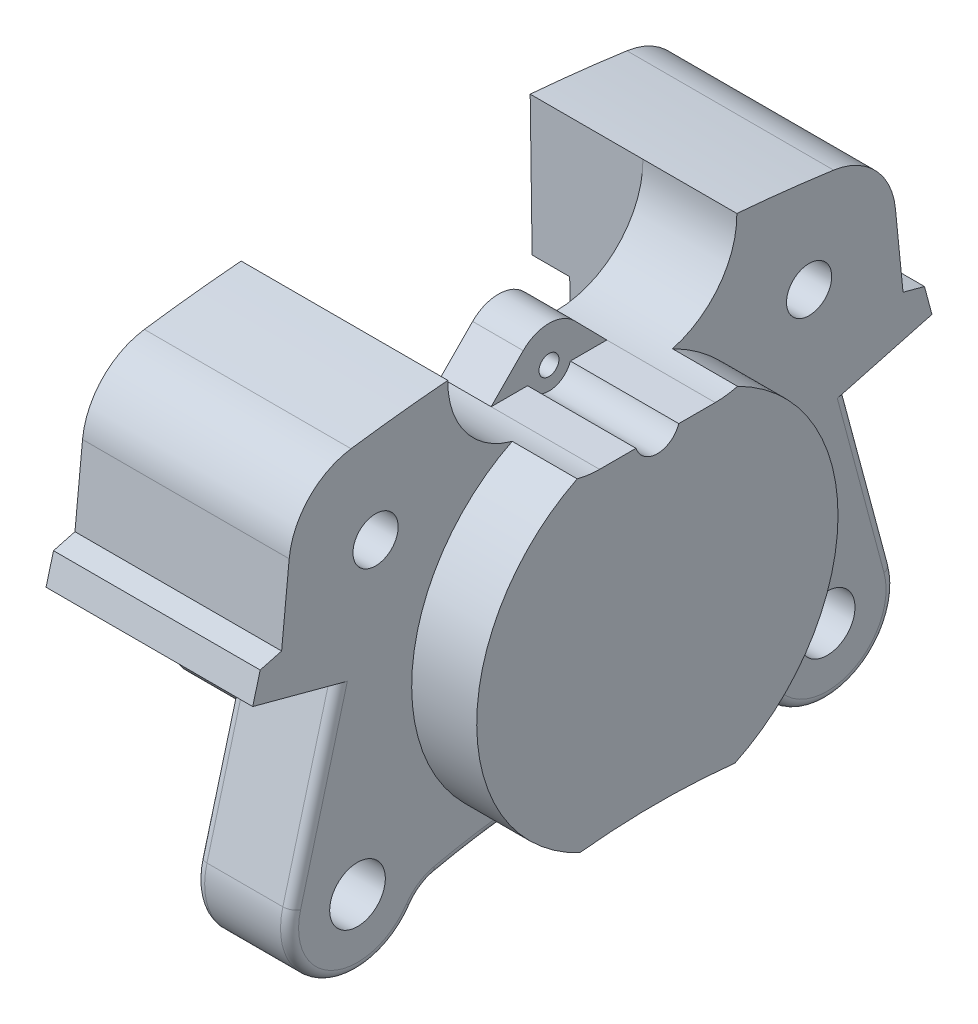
ISO-10303-21;
HEADER;
FILE_DESCRIPTION(('STEP AP214'),'2;1');
FILE_NAME('part.step','',(''),(''),'','','');
FILE_SCHEMA(('AUTOMOTIVE_DESIGN { 1 0 10303 214 1 1 1 1 }'));
ENDSEC;
DATA;
#1=APPLICATION_CONTEXT('core data for automotive mechanical design processes');
#2=APPLICATION_PROTOCOL_DEFINITION('international standard','automotive_design',2000,#1);
#3=PRODUCT_CONTEXT('',#1,'mechanical');
#4=PRODUCT('Part','Part','',(#3));
#5=PRODUCT_RELATED_PRODUCT_CATEGORY('part','',(#4));
#6=PRODUCT_DEFINITION_FORMATION('','',#4);
#7=PRODUCT_DEFINITION_CONTEXT('part definition',#1,'design');
#8=PRODUCT_DEFINITION('design','',#6,#7);
#9=PRODUCT_DEFINITION_SHAPE('','',#8);
#10=(LENGTH_UNIT() NAMED_UNIT(*) SI_UNIT(.MILLI.,.METRE.));
#11=(NAMED_UNIT(*) PLANE_ANGLE_UNIT() SI_UNIT($,.RADIAN.));
#12=(NAMED_UNIT(*) SI_UNIT($,.STERADIAN.) SOLID_ANGLE_UNIT());
#13=UNCERTAINTY_MEASURE_WITH_UNIT(LENGTH_MEASURE(1.E-05),#10,'distance_accuracy_value','');
#14=(GEOMETRIC_REPRESENTATION_CONTEXT(3) GLOBAL_UNCERTAINTY_ASSIGNED_CONTEXT((#13)) GLOBAL_UNIT_ASSIGNED_CONTEXT((#10,
#11,#12)) REPRESENTATION_CONTEXT('',''));
#15=CARTESIAN_POINT('',(0.,0.,0.));
#16=DIRECTION('',(0.,0.,1.));
#17=DIRECTION('',(1.,0.,0.));
#18=AXIS2_PLACEMENT_3D('',#15,#16,#17);
#19=CARTESIAN_POINT('',(-27.94,27.94,10.1614444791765));
#20=DIRECTION('',(0.,-1.,0.));
#21=DIRECTION('',(0.,0.,-1.));
#22=AXIS2_PLACEMENT_3D('',#19,#20,#21);
#23=PLANE('',#22);
#24=DIRECTION('',(-1.,0.,0.));
#25=VECTOR('',#24,1.);
#26=CARTESIAN_POINT('',(0.,27.94,3.76006337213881));
#27=LINE('',#26,#25);
#28=CARTESIAN_POINT('',(-19.05,27.94,3.76006337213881));
#29=VERTEX_POINT('',#28);
#30=CARTESIAN_POINT('',(0.,27.94,3.76006337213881));
#31=VERTEX_POINT('',#30);
#32=EDGE_CURVE('E358',#29,#31,#27,.F.);
#33=ORIENTED_EDGE('',*,*,#32,.F.);
#34=DIRECTION('',(0.,0.,-1.));
#35=VECTOR('',#34,1.);
#36=CARTESIAN_POINT('',(-19.05,27.94,10.1614444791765));
#37=LINE('',#36,#35);
#38=CARTESIAN_POINT('',(-19.05,27.94,10.1614444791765));
#39=VERTEX_POINT('',#38);
#40=EDGE_CURVE('E1434',#39,#29,#37,.T.);
#41=ORIENTED_EDGE('',*,*,#40,.F.);
#42=DIRECTION('',(1.,0.,0.));
#43=VECTOR('',#42,1.);
#44=CARTESIAN_POINT('',(-27.94,27.94,10.1614444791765));
#45=LINE('',#44,#43);
#46=CARTESIAN_POINT('',(0.,27.94,10.1614444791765));
#47=VERTEX_POINT('',#46);
#48=EDGE_CURVE('E475',#39,#47,#45,.T.);
#49=ORIENTED_EDGE('',*,*,#48,.T.);
#50=DIRECTION('',(0.,0.,1.));
#51=VECTOR('',#50,1.);
#52=CARTESIAN_POINT('',(0.,27.94,-10.1614444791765));
#53=LINE('',#52,#51);
#54=EDGE_CURVE('E377',#31,#47,#53,.T.);
#55=ORIENTED_EDGE('',*,*,#54,.F.);
#56=EDGE_LOOP('',(#33,#41,#49,#55));
#57=FACE_BOUND('',#56,.T.);
#58=ADVANCED_FACE('F28',(#57),#23,.F.);
#59=DIRECTION('',(-1.,0.,0.));
#60=VECTOR('',#59,1.);
#61=CARTESIAN_POINT('',(0.,27.94,-3.76006337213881));
#62=LINE('',#61,#60);
#63=CARTESIAN_POINT('',(0.,27.94,-3.76006337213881));
#64=VERTEX_POINT('',#63);
#65=CARTESIAN_POINT('',(-19.05,27.94,-3.76006337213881));
#66=VERTEX_POINT('',#65);
#67=EDGE_CURVE('E355',#64,#66,#62,.T.);
#68=ORIENTED_EDGE('',*,*,#67,.F.);
#69=CARTESIAN_POINT('',(0.,27.94,-10.1614444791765));
#70=VERTEX_POINT('',#69);
#71=EDGE_CURVE('E369',#70,#64,#53,.T.);
#72=ORIENTED_EDGE('',*,*,#71,.F.);
#73=DIRECTION('',(1.,0.,0.));
#74=VECTOR('',#73,1.);
#75=CARTESIAN_POINT('',(-27.94,27.94,-10.1614444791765));
#76=LINE('',#75,#74);
#77=CARTESIAN_POINT('',(-19.05,27.94,-10.1614444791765));
#78=VERTEX_POINT('',#77);
#79=EDGE_CURVE('E471',#78,#70,#76,.T.);
#80=ORIENTED_EDGE('',*,*,#79,.F.);
#81=EDGE_CURVE('E371',#66,#78,#37,.T.);
#82=ORIENTED_EDGE('',*,*,#81,.F.);
#83=EDGE_LOOP('',(#68,#72,#80,#82));
#84=FACE_BOUND('',#83,.T.);
#85=ADVANCED_FACE('F367',(#84),#23,.F.);
#86=CARTESIAN_POINT('',(0.,0.,0.));
#87=DIRECTION('',(1.,0.,0.));
#88=DIRECTION('',(0.,0.,-1.));
#89=AXIS2_PLACEMENT_3D('',#86,#87,#88);
#90=PLANE('',#89);
#91=ORIENTED_EDGE('',*,*,#71,.T.);
#92=CARTESIAN_POINT('',(0.,29.21,0.));
#93=DIRECTION('',(1.,0.,0.));
#94=DIRECTION('',(0.,0.,-1.));
#95=AXIS2_PLACEMENT_3D('',#92,#93,#94);
#96=CIRCLE('',#95,3.96875);
#97=EDGE_CURVE('E352',#31,#64,#96,.T.);
#98=ORIENTED_EDGE('',*,*,#97,.F.);
#99=ORIENTED_EDGE('',*,*,#54,.T.);
#100=CARTESIAN_POINT('',(0.,43.18,10.1614444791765));
#101=DIRECTION('',(1.,0.,0.));
#102=DIRECTION('',(0.,0.,-1.));
#103=AXIS2_PLACEMENT_3D('',#100,#101,#102);
#104=CIRCLE('',#103,15.24);
#105=CARTESIAN_POINT('',(0.,28.454095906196,14.0864092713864));
#106=VERTEX_POINT('',#105);
#107=EDGE_CURVE('E376',#47,#106,#104,.F.);
#108=ORIENTED_EDGE('',*,*,#107,.T.);
#109=CARTESIAN_POINT('',(0.,0.,0.));
#110=DIRECTION('',(1.,0.,0.));
#111=DIRECTION('',(0.,0.,-1.));
#112=AXIS2_PLACEMENT_3D('',#109,#110,#111);
#113=CIRCLE('',#112,31.75);
#114=CARTESIAN_POINT('',(0.,-28.6738934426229,13.6334271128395));
#115=VERTEX_POINT('',#114);
#116=EDGE_CURVE('E499',#106,#115,#113,.T.);
#117=ORIENTED_EDGE('',*,*,#116,.T.);
#118=CARTESIAN_POINT('',(0.,-154.94,0.));
#119=DIRECTION('',(1.,0.,0.));
#120=DIRECTION('',(0.,0.,-1.));
#121=AXIS2_PLACEMENT_3D('',#118,#119,#120);
#122=CIRCLE('',#121,127.);
#123=CARTESIAN_POINT('',(0.,-28.6738934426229,-13.6334271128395));
#124=VERTEX_POINT('',#123);
#125=EDGE_CURVE('E1471',#115,#124,#122,.F.);
#126=ORIENTED_EDGE('',*,*,#125,.T.);
#127=CARTESIAN_POINT('',(0.,28.454095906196,-14.0864092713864));
#128=VERTEX_POINT('',#127);
#129=EDGE_CURVE('E498',#124,#128,#113,.T.);
#130=ORIENTED_EDGE('',*,*,#129,.T.);
#131=CARTESIAN_POINT('',(0.,43.18,-10.1614444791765));
#132=DIRECTION('',(1.,0.,0.));
#133=DIRECTION('',(0.,0.,-1.));
#134=AXIS2_PLACEMENT_3D('',#131,#132,#133);
#135=CIRCLE('',#134,15.24);
#136=EDGE_CURVE('E375',#128,#70,#135,.F.);
#137=ORIENTED_EDGE('',*,*,#136,.T.);
#138=EDGE_LOOP('',(#91,#98,#99,#108,#117,#126,#130,#137));
#139=FACE_BOUND('',#138,.T.);
#140=ADVANCED_FACE('F373',(#139),#90,.T.);
#141=CARTESIAN_POINT('',(-27.94,-154.94,0.));
#142=DIRECTION('',(1.,0.,0.));
#143=DIRECTION('',(0.,0.,-1.));
#144=AXIS2_PLACEMENT_3D('',#141,#142,#143);
#145=PLANE('',#144);
#146=CARTESIAN_POINT('',(-27.94,29.21,0.));
#147=DIRECTION('',(1.,0.,0.));
#148=DIRECTION('',(0.,0.,-1.));
#149=AXIS2_PLACEMENT_3D('',#146,#147,#148);
#150=CIRCLE('',#149,1.7526);
#151=CARTESIAN_POINT('',(-27.94,29.21,-1.7526));
#152=VERTEX_POINT('',#151);
#153=EDGE_CURVE('E1415',#152,#152,#150,.T.);
#154=ORIENTED_EDGE('',*,*,#153,.T.);
#155=EDGE_LOOP('',(#154));
#156=FACE_BOUND('',#155,.T.);
#157=CARTESIAN_POINT('',(-27.94,-26.924,-41.275));
#158=DIRECTION('',(-1.,0.,0.));
#159=DIRECTION('',(0.,0.,1.));
#160=AXIS2_PLACEMENT_3D('',#157,#158,#159);
#161=CIRCLE('',#160,4.8895);
#162=CARTESIAN_POINT('',(-27.94,-26.924,-36.3855));
#163=VERTEX_POINT('',#162);
#164=EDGE_CURVE('E398',#163,#163,#161,.T.);
#165=ORIENTED_EDGE('',*,*,#164,.F.);
#166=EDGE_LOOP('',(#165));
#167=FACE_BOUND('',#166,.T.);
#168=CARTESIAN_POINT('',(-27.94,-26.924,41.275));
#169=DIRECTION('',(-1.,0.,0.));
#170=DIRECTION('',(0.,0.,1.));
#171=AXIS2_PLACEMENT_3D('',#168,#169,#170);
#172=CIRCLE('',#171,4.8895);
#173=CARTESIAN_POINT('',(-27.94,-26.924,46.1645));
#174=VERTEX_POINT('',#173);
#175=EDGE_CURVE('E404',#174,#174,#172,.T.);
#176=ORIENTED_EDGE('',*,*,#175,.F.);
#177=EDGE_LOOP('',(#176));
#178=FACE_BOUND('',#177,.T.);
#179=CARTESIAN_POINT('',(-27.94,-26.924,41.275));
#180=DIRECTION('',(1.,0.,0.));
#181=DIRECTION('',(0.,0.,-1.));
#182=AXIS2_PLACEMENT_3D('',#179,#180,#181);
#183=CIRCLE('',#182,10.3505);
#184=CARTESIAN_POINT('',(-27.94,-32.7115227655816,32.693774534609));
#185=VERTEX_POINT('',#184);
#186=CARTESIAN_POINT('',(-27.94,-24.2450934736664,51.272815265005));
#187=VERTEX_POINT('',#186);
#188=EDGE_CURVE('E700',#185,#187,#183,.F.);
#189=ORIENTED_EDGE('',*,*,#188,.T.);
#190=DIRECTION('',(0.,0.96592582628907,-0.258819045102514));
#191=VECTOR('',#190,1.);
#192=CARTESIAN_POINT('',(-27.94,-133.366897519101,80.5119145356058));
#193=LINE('',#192,#191);
#194=CARTESIAN_POINT('',(-27.94,2.21004971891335,44.1841810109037));
#195=VERTEX_POINT('',#194);
#196=EDGE_CURVE('E702',#187,#195,#193,.T.);
#197=ORIENTED_EDGE('',*,*,#196,.T.);
#198=DIRECTION('',(0.,-0.996194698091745,-0.087155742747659));
#199=VECTOR('',#198,1.);
#200=CARTESIAN_POINT('',(-27.94,6.83392674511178,44.5887178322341));
#201=LINE('',#200,#199);
#202=CARTESIAN_POINT('',(-27.94,-3.34743896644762,43.6979637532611));
#203=VERTEX_POINT('',#202);
#204=EDGE_CURVE('E604',#195,#203,#201,.T.);
#205=ORIENTED_EDGE('',*,*,#204,.T.);
#206=CARTESIAN_POINT('',(-27.94,-2.79399999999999,37.3721274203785));
#207=DIRECTION('',(1.,0.,0.));
#208=DIRECTION('',(0.,0.,-1.));
#209=AXIS2_PLACEMENT_3D('',#206,#207,#208);
#210=CIRCLE('',#209,6.35);
#211=CARTESIAN_POINT('',(-27.94,-9.14399999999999,37.3721274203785));
#212=VERTEX_POINT('',#211);
#213=EDGE_CURVE('E607',#203,#212,#210,.T.);
#214=ORIENTED_EDGE('',*,*,#213,.T.);
#215=DIRECTION('',(0.,0.,-1.));
#216=VECTOR('',#215,1.);
#217=CARTESIAN_POINT('',(-27.94,-9.14399999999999,37.3721274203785));
#218=LINE('',#217,#216);
#219=CARTESIAN_POINT('',(-27.94,-9.14399999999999,26.1233492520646));
#220=VERTEX_POINT('',#219);
#221=EDGE_CURVE('E613',#212,#220,#218,.T.);
#222=ORIENTED_EDGE('',*,*,#221,.T.);
#223=DIRECTION('',(0.,-0.999905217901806,0.0137679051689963));
#224=VECTOR('',#223,1.);
#225=CARTESIAN_POINT('',(-27.94,43.3898228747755,25.4));
#226=LINE('',#225,#224);
#227=CARTESIAN_POINT('',(-27.94,43.3898228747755,25.4));
#228=VERTEX_POINT('',#227);
#229=EDGE_CURVE('E620',#228,#220,#226,.T.);
#230=ORIENTED_EDGE('',*,*,#229,.F.);
#231=CARTESIAN_POINT('',(-27.94,43.18,10.1614444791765));
#232=DIRECTION('',(1.,0.,0.));
#233=DIRECTION('',(0.,0.,-1.));
#234=AXIS2_PLACEMENT_3D('',#231,#232,#233);
#235=CIRCLE('',#234,15.24);
#236=CARTESIAN_POINT('',(-27.94,27.94,10.1614444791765));
#237=VERTEX_POINT('',#236);
#238=EDGE_CURVE('E447',#228,#237,#235,.T.);
#239=ORIENTED_EDGE('',*,*,#238,.T.);
#240=DIRECTION('',(0.,-0.712595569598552,0.701575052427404));
#241=VECTOR('',#240,1.);
#242=CARTESIAN_POINT('',(-27.94,33.6650015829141,4.52498186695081));
#243=LINE('',#242,#241);
#244=CARTESIAN_POINT('',(-27.94,33.6650015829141,4.52498186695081));
#245=VERTEX_POINT('',#244);
#246=EDGE_CURVE('E1426',#245,#237,#243,.T.);
#247=ORIENTED_EDGE('',*,*,#246,.F.);
#248=CARTESIAN_POINT('',(-27.94,29.21,0.));
#249=DIRECTION('',(-1.,0.,0.));
#250=DIRECTION('',(0.,0.,1.));
#251=AXIS2_PLACEMENT_3D('',#248,#249,#250);
#252=CIRCLE('',#251,6.35);
#253=CARTESIAN_POINT('',(-27.94,33.6650015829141,-4.52498186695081));
#254=VERTEX_POINT('',#253);
#255=EDGE_CURVE('E1420',#245,#254,#252,.T.);
#256=ORIENTED_EDGE('',*,*,#255,.T.);
#257=DIRECTION('',(0.,-0.712595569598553,-0.701575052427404));
#258=VECTOR('',#257,1.);
#259=CARTESIAN_POINT('',(-27.94,33.6650015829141,-4.52498186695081));
#260=LINE('',#259,#258);
#261=CARTESIAN_POINT('',(-27.94,27.94,-10.1614444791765));
#262=VERTEX_POINT('',#261);
#263=EDGE_CURVE('E1423',#254,#262,#260,.T.);
#264=ORIENTED_EDGE('',*,*,#263,.T.);
#265=CARTESIAN_POINT('',(-27.94,43.18,-10.1614444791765));
#266=DIRECTION('',(-1.,0.,0.));
#267=DIRECTION('',(0.,0.,1.));
#268=AXIS2_PLACEMENT_3D('',#265,#266,#267);
#269=CIRCLE('',#268,15.24);
#270=CARTESIAN_POINT('',(-27.94,43.3898228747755,-25.4));
#271=VERTEX_POINT('',#270);
#272=EDGE_CURVE('E450',#271,#262,#269,.T.);
#273=ORIENTED_EDGE('',*,*,#272,.F.);
#274=DIRECTION('',(0.,-0.999905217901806,-0.0137679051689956));
#275=VECTOR('',#274,1.);
#276=CARTESIAN_POINT('',(-27.94,43.3898228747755,-25.4));
#277=LINE('',#276,#275);
#278=CARTESIAN_POINT('',(-27.94,-9.14399999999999,-26.1233492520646));
#279=VERTEX_POINT('',#278);
#280=EDGE_CURVE('E527',#271,#279,#277,.T.);
#281=ORIENTED_EDGE('',*,*,#280,.T.);
#282=DIRECTION('',(0.,0.,1.));
#283=VECTOR('',#282,1.);
#284=CARTESIAN_POINT('',(-27.94,-9.14399999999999,-37.3721274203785));
#285=LINE('',#284,#283);
#286=CARTESIAN_POINT('',(-27.94,-9.14399999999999,-37.3721274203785));
#287=VERTEX_POINT('',#286);
#288=EDGE_CURVE('E517',#287,#279,#285,.T.);
#289=ORIENTED_EDGE('',*,*,#288,.F.);
#290=CARTESIAN_POINT('',(-27.94,-2.79399999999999,-37.3721274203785));
#291=DIRECTION('',(-1.,0.,0.));
#292=DIRECTION('',(0.,0.,1.));
#293=AXIS2_PLACEMENT_3D('',#290,#291,#292);
#294=CIRCLE('',#293,6.35);
#295=CARTESIAN_POINT('',(-27.94,-3.34743896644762,-43.6979637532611));
#296=VERTEX_POINT('',#295);
#297=EDGE_CURVE('E532',#296,#287,#294,.T.);
#298=ORIENTED_EDGE('',*,*,#297,.F.);
#299=DIRECTION('',(0.,-0.996194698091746,0.0871557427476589));
#300=VECTOR('',#299,1.);
#301=CARTESIAN_POINT('',(-27.94,6.8339267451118,-44.5887178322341));
#302=LINE('',#301,#300);
#303=CARTESIAN_POINT('',(-27.94,2.21004971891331,-44.1841810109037));
#304=VERTEX_POINT('',#303);
#305=EDGE_CURVE('E530',#304,#296,#302,.T.);
#306=ORIENTED_EDGE('',*,*,#305,.F.);
#307=DIRECTION('',(0.,0.96592582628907,0.258819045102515));
#308=VECTOR('',#307,1.);
#309=CARTESIAN_POINT('',(-27.94,-24.2450934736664,-51.272815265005));
#310=LINE('',#309,#308);
#311=CARTESIAN_POINT('',(-27.94,-24.2450934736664,-51.272815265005));
#312=VERTEX_POINT('',#311);
#313=EDGE_CURVE('E690',#304,#312,#310,.F.);
#314=ORIENTED_EDGE('',*,*,#313,.T.);
#315=CARTESIAN_POINT('',(-27.94,-26.924,-41.275));
#316=DIRECTION('',(1.,0.,0.));
#317=DIRECTION('',(0.,0.,-1.));
#318=AXIS2_PLACEMENT_3D('',#315,#316,#317);
#319=CIRCLE('',#318,10.3505);
#320=CARTESIAN_POINT('',(-27.94,-32.7115227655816,-32.693774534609));
#321=VERTEX_POINT('',#320);
#322=EDGE_CURVE('E692',#312,#321,#319,.F.);
#323=ORIENTED_EDGE('',*,*,#322,.T.);
#324=CARTESIAN_POINT('',(-27.94,-37.1498070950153,-26.1130801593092));
#325=DIRECTION('',(1.,0.,0.));
#326=DIRECTION('',(0.,0.,-1.));
#327=AXIS2_PLACEMENT_3D('',#324,#325,#326);
#328=CIRCLE('',#327,7.9375);
#329=CARTESIAN_POINT('',(-27.94,-29.4004522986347,-27.8310459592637));
#330=VERTEX_POINT('',#329);
#331=EDGE_CURVE('E694',#321,#330,#328,.T.);
#332=ORIENTED_EDGE('',*,*,#331,.T.);
#333=CARTESIAN_POINT('',(-27.94,-154.94,0.));
#334=DIRECTION('',(1.,0.,0.));
#335=DIRECTION('',(0.,0.,-1.));
#336=AXIS2_PLACEMENT_3D('',#333,#334,#335);
#337=CIRCLE('',#336,128.5875);
#338=CARTESIAN_POINT('',(-27.94,-29.4004522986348,27.8310459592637));
#339=VERTEX_POINT('',#338);
#340=EDGE_CURVE('E696',#330,#339,#337,.T.);
#341=ORIENTED_EDGE('',*,*,#340,.T.);
#342=CARTESIAN_POINT('',(-27.94,-37.1498070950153,26.1130801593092));
#343=DIRECTION('',(1.,0.,0.));
#344=DIRECTION('',(0.,0.,-1.));
#345=AXIS2_PLACEMENT_3D('',#342,#343,#344);
#346=CIRCLE('',#345,7.9375);
#347=EDGE_CURVE('E698',#339,#185,#346,.T.);
#348=ORIENTED_EDGE('',*,*,#347,.T.);
#349=EDGE_LOOP('',(#189,#197,#205,#214,#222,#230,#239,#247,#256,#264,#273,#281,#289,#298,#306,
#314,#323,#332,#341,#348));
#350=FACE_BOUND('',#349,.T.);
#351=ADVANCED_FACE('F645',(#156,#167,#178,#350),#145,.F.);
#352=CARTESIAN_POINT('',(-11.43,0.,0.));
#353=DIRECTION('',(1.,0.,0.));
#354=DIRECTION('',(0.,0.,-1.));
#355=AXIS2_PLACEMENT_3D('',#352,#353,#354);
#356=CYLINDRICAL_SURFACE('',#355,31.75);
#357=DIRECTION('',(-1.,0.,0.));
#358=VECTOR('',#357,1.);
#359=CARTESIAN_POINT('',(0.000999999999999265,-28.6738934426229,-13.6334271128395));
#360=LINE('',#359,#358);
#361=CARTESIAN_POINT('',(-13.0175,-28.6738934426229,-13.6334271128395));
#362=VERTEX_POINT('',#361);
#363=EDGE_CURVE('E1465',#124,#362,#360,.T.);
#364=ORIENTED_EDGE('',*,*,#363,.T.);
#365=CARTESIAN_POINT('',(-13.0175,-28.6738934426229,-13.6334271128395));
#366=CARTESIAN_POINT('',(-12.9922894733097,-28.67389627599,-13.6334206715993));
#367=CARTESIAN_POINT('',(-12.9670924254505,-28.673400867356,-13.6344631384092));
#368=CARTESIAN_POINT('',(-12.9169291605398,-28.6714419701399,-13.6385821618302));
#369=CARTESIAN_POINT('',(-12.8919627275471,-28.6699795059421,-13.6416565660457));
#370=CARTESIAN_POINT('',(-12.8181908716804,-28.6642258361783,-13.6537445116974));
#371=CARTESIAN_POINT('',(-12.7699393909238,-28.6585669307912,-13.665625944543));
#372=CARTESIAN_POINT('',(-12.6648804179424,-28.6423118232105,-13.6996678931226));
#373=CARTESIAN_POINT('',(-12.6087976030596,-28.630856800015,-13.7236106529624));
#374=CARTESIAN_POINT('',(-12.5014981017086,-28.6040786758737,-13.7793375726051));
#375=CARTESIAN_POINT('',(-12.4503046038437,-28.5887382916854,-13.8111567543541));
#376=CARTESIAN_POINT('',(-12.3264638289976,-28.5459788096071,-13.899392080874));
#377=CARTESIAN_POINT('',(-12.2573600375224,-28.516537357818,-13.9597536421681));
#378=CARTESIAN_POINT('',(-12.1299545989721,-28.4530320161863,-14.0887430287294));
#379=CARTESIAN_POINT('',(-12.0716756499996,-28.4189586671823,-14.1573877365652));
#380=CARTESIAN_POINT('',(-11.9711440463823,-28.3519903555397,-14.2909767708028));
#381=CARTESIAN_POINT('',(-11.9277982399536,-28.3194829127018,-14.3553066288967));
#382=CARTESIAN_POINT('',(-11.8473747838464,-28.2524401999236,-14.4868069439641));
#383=CARTESIAN_POINT('',(-11.8103017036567,-28.2179034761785,-14.5539794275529));
#384=CARTESIAN_POINT('',(-11.7417545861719,-28.1470757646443,-14.6904921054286));
#385=CARTESIAN_POINT('',(-11.7102964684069,-28.1107801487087,-14.7598378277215));
#386=CARTESIAN_POINT('',(-11.6526726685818,-28.0367621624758,-14.8999580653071));
#387=CARTESIAN_POINT('',(-11.6265081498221,-27.9990394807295,-14.9707328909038));
#388=CARTESIAN_POINT('',(-11.5738791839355,-27.9137470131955,-15.1292776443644));
#389=CARTESIAN_POINT('',(-11.5486653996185,-27.8658673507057,-15.2172968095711));
#390=CARTESIAN_POINT('',(-11.5054624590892,-27.7685105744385,-15.3942368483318));
#391=CARTESIAN_POINT('',(-11.487475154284,-27.7190330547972,-15.4831579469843));
#392=CARTESIAN_POINT('',(-11.4588185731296,-27.6193130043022,-15.6603398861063));
#393=CARTESIAN_POINT('',(-11.4480653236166,-27.5690864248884,-15.7485961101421));
#394=CARTESIAN_POINT('',(-11.4336718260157,-27.4675613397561,-15.9250112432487));
#395=CARTESIAN_POINT('',(-11.4300279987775,-27.4162633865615,-16.0131701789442));
#396=CARTESIAN_POINT('',(-11.43,-27.36453125,-16.1010847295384));
#397=B_SPLINE_CURVE_WITH_KNOTS('',3,(#365,#366,#367,#368,#369,#370,#371,#372,#373,#374,#375,
#376,#377,#378,#379,#380,#381,#382,#383,#384,#385,#386,#387,#388,#389,#390,#391,#392,#393,#394,
#395,#396),.UNSPECIFIED.,.F.,.F.,(4,2,2,2,2,2,2,2,2,2,2,2,2,2,2,4),(0.,0.0755802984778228,
0.151080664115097,0.300385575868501,0.485511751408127,0.67147634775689,0.958954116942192,
1.24702804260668,1.49899781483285,1.75115035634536,2.00400682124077,2.25691879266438,
2.56659400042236,2.87634849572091,3.18244227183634,3.48838190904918),.UNSPECIFIED.);
#398=CARTESIAN_POINT('',(-11.43,-27.36453125,-16.1010847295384));
#399=VERTEX_POINT('',#398);
#400=EDGE_CURVE('E656',#362,#399,#397,.T.);
#401=ORIENTED_EDGE('',*,*,#400,.T.);
#402=CARTESIAN_POINT('',(-11.43,0.,0.));
#403=DIRECTION('',(1.,0.,0.));
#404=DIRECTION('',(0.,0.,-1.));
#405=AXIS2_PLACEMENT_3D('',#402,#403,#404);
#406=CIRCLE('',#405,31.75);
#407=CARTESIAN_POINT('',(-11.43,28.454095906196,-14.0864092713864));
#408=VERTEX_POINT('',#407);
#409=EDGE_CURVE('E502',#399,#408,#406,.T.);
#410=ORIENTED_EDGE('',*,*,#409,.T.);
#411=DIRECTION('',(-1.,0.,0.));
#412=VECTOR('',#411,1.);
#413=CARTESIAN_POINT('',(0.000999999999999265,28.454095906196,-14.0864092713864));
#414=LINE('',#413,#412);
#415=EDGE_CURVE('E385',#128,#408,#414,.T.);
#416=ORIENTED_EDGE('',*,*,#415,.F.);
#417=ORIENTED_EDGE('',*,*,#129,.F.);
#418=EDGE_LOOP('',(#364,#401,#410,#416,#417));
#419=FACE_BOUND('',#418,.T.);
#420=ADVANCED_FACE('F842',(#419),#356,.T.);
#421=DIRECTION('',(-1.,0.,0.));
#422=VECTOR('',#421,1.);
#423=CARTESIAN_POINT('',(0.000999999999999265,-28.6738934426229,13.6334271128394));
#424=LINE('',#423,#422);
#425=CARTESIAN_POINT('',(-13.0175,-28.6738934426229,13.6334271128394));
#426=VERTEX_POINT('',#425);
#427=EDGE_CURVE('E1463',#115,#426,#424,.T.);
#428=ORIENTED_EDGE('',*,*,#427,.F.);
#429=ORIENTED_EDGE('',*,*,#116,.F.);
#430=DIRECTION('',(-1.,0.,0.));
#431=VECTOR('',#430,1.);
#432=CARTESIAN_POINT('',(0.000999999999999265,28.454095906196,14.0864092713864));
#433=LINE('',#432,#431);
#434=CARTESIAN_POINT('',(-11.43,28.454095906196,14.0864092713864));
#435=VERTEX_POINT('',#434);
#436=EDGE_CURVE('E380',#106,#435,#433,.T.);
#437=ORIENTED_EDGE('',*,*,#436,.T.);
#438=CARTESIAN_POINT('',(-11.43,-27.36453125,16.1010847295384));
#439=VERTEX_POINT('',#438);
#440=EDGE_CURVE('E504',#435,#439,#406,.T.);
#441=ORIENTED_EDGE('',*,*,#440,.T.);
#442=CARTESIAN_POINT('',(-11.43,-27.36453125,16.1010847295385));
#443=CARTESIAN_POINT('',(-11.4300030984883,-27.395305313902,16.0487832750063));
#444=CARTESIAN_POINT('',(-11.4312988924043,-27.4259243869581,15.9964011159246));
#445=CARTESIAN_POINT('',(-11.4364302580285,-27.4868073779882,15.8915572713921));
#446=CARTESIAN_POINT('',(-11.4402657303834,-27.5170713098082,15.8390955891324));
#447=CARTESIAN_POINT('',(-11.4555270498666,-27.6073469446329,15.6815670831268));
#448=CARTESIAN_POINT('',(-11.4707075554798,-27.6667596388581,15.5764976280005));
#449=CARTESIAN_POINT('',(-11.5111612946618,-27.7841152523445,15.3661990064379));
#450=CARTESIAN_POINT('',(-11.5365252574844,-27.8420398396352,15.2609771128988));
#451=CARTESIAN_POINT('',(-11.5976009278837,-27.9553977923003,15.0523195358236));
#452=CARTESIAN_POINT('',(-11.6333038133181,-28.0108332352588,14.9488824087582));
#453=CARTESIAN_POINT('',(-11.7179693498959,-28.1215754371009,14.7395451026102));
#454=CARTESIAN_POINT('',(-11.7675235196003,-28.1767264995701,14.6337952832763));
#455=CARTESIAN_POINT('',(-11.852240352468,-28.2562236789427,14.4793539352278));
#456=CARTESIAN_POINT('',(-11.8821877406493,-28.2821689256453,14.4286018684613));
#457=CARTESIAN_POINT('',(-11.9458701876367,-28.3328159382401,14.3288926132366));
#458=CARTESIAN_POINT('',(-11.9796042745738,-28.3575180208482,14.2799349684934));
#459=CARTESIAN_POINT('',(-12.0672053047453,-28.416128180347,14.1630545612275));
#460=CARTESIAN_POINT('',(-12.1233460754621,-28.4492347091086,14.096399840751));
#461=CARTESIAN_POINT('',(-12.2457394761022,-28.5111775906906,13.9706881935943));
#462=CARTESIAN_POINT('',(-12.311976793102,-28.5400202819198,13.9116200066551));
#463=CARTESIAN_POINT('',(-12.4301503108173,-28.5822207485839,13.824637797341));
#464=CARTESIAN_POINT('',(-12.4787505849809,-28.597430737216,13.7931297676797));
#465=CARTESIAN_POINT('',(-12.5805340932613,-28.6243820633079,13.737110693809));
#466=CARTESIAN_POINT('',(-12.6336970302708,-28.6361378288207,13.7125705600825));
#467=CARTESIAN_POINT('',(-12.7407135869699,-28.654691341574,13.6737561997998));
#468=CARTESIAN_POINT('',(-12.794314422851,-28.6617539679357,13.6589343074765));
#469=CARTESIAN_POINT('',(-12.8766530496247,-28.6689640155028,13.643790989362));
#470=CARTESIAN_POINT('',(-12.9046210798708,-28.6708040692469,13.6399232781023));
#471=CARTESIAN_POINT('',(-12.9608855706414,-28.6732718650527,13.6347344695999));
#472=CARTESIAN_POINT('',(-12.9891824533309,-28.6738978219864,13.6334171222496));
#473=CARTESIAN_POINT('',(-13.0175,-28.6738934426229,13.6334271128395));
#474=B_SPLINE_CURVE_WITH_KNOTS('',3,(#442,#443,#444,#445,#446,#447,#448,#449,#450,#451,#452,
#453,#454,#455,#456,#457,#458,#459,#460,#461,#462,#463,#464,#465,#466,#467,#468,#469,#470,#471,
#472,#473),.UNSPECIFIED.,.F.,.F.,(4,2,2,2,2,2,2,2,2,2,2,2,2,2,2,4),(0.,0.182019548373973,
0.36403197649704,0.728545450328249,1.0963812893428,1.46390417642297,1.85048251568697,
2.04352469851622,2.23651744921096,2.51549133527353,2.79404624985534,2.97316089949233,
3.15151640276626,3.31867740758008,3.40343035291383,3.48830781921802),.UNSPECIFIED.);
#475=EDGE_CURVE('E713',#439,#426,#474,.T.);
#476=ORIENTED_EDGE('',*,*,#475,.T.);
#477=EDGE_LOOP('',(#428,#429,#437,#441,#476));
#478=FACE_BOUND('',#477,.T.);
#479=ADVANCED_FACE('F30',(#478),#356,.T.);
#480=CARTESIAN_POINT('',(-11.43,-154.94,0.));
#481=DIRECTION('',(1.,0.,0.));
#482=DIRECTION('',(0.,0.,-1.));
#483=AXIS2_PLACEMENT_3D('',#480,#481,#482);
#484=PLANE('',#483);
#485=CARTESIAN_POINT('',(-11.43,25.4635,38.1));
#486=DIRECTION('',(-1.,0.,0.));
#487=DIRECTION('',(0.,0.,1.));
#488=AXIS2_PLACEMENT_3D('',#485,#486,#487);
#489=CIRCLE('',#488,3.96875);
#490=CARTESIAN_POINT('',(-11.43,25.4635,42.06875));
#491=VERTEX_POINT('',#490);
#492=EDGE_CURVE('E388',#491,#491,#489,.T.);
#493=ORIENTED_EDGE('',*,*,#492,.T.);
#494=EDGE_LOOP('',(#493));
#495=FACE_BOUND('',#494,.T.);
#496=CARTESIAN_POINT('',(-11.43,-26.924,41.275));
#497=DIRECTION('',(-1.,0.,0.));
#498=DIRECTION('',(0.,0.,1.));
#499=AXIS2_PLACEMENT_3D('',#496,#497,#498);
#500=CIRCLE('',#499,4.8895);
#501=CARTESIAN_POINT('',(-11.43,-26.924,46.1645));
#502=VERTEX_POINT('',#501);
#503=EDGE_CURVE('E401',#502,#502,#500,.T.);
#504=ORIENTED_EDGE('',*,*,#503,.T.);
#505=EDGE_LOOP('',(#504));
#506=FACE_BOUND('',#505,.T.);
#507=CARTESIAN_POINT('',(-11.43,-37.1498070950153,26.1130801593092));
#508=DIRECTION('',(1.,0.,0.));
#509=DIRECTION('',(0.,0.,-1.));
#510=AXIS2_PLACEMENT_3D('',#507,#508,#509);
#511=CIRCLE('',#510,7.9375);
#512=CARTESIAN_POINT('',(-11.43,-32.7115227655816,32.693774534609));
#513=VERTEX_POINT('',#512);
#514=CARTESIAN_POINT('',(-11.43,-29.4004522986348,27.8310459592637));
#515=VERTEX_POINT('',#514);
#516=EDGE_CURVE('E1369',#513,#515,#511,.F.);
#517=ORIENTED_EDGE('',*,*,#516,.T.);
#518=CARTESIAN_POINT('',(-11.43,-154.94,0.));
#519=DIRECTION('',(1.,0.,0.));
#520=DIRECTION('',(0.,0.,-1.));
#521=AXIS2_PLACEMENT_3D('',#518,#519,#520);
#522=CIRCLE('',#521,128.5875);
#523=EDGE_CURVE('E1371',#515,#439,#522,.F.);
#524=ORIENTED_EDGE('',*,*,#523,.T.);
#525=ORIENTED_EDGE('',*,*,#440,.F.);
#526=CARTESIAN_POINT('',(-11.43,43.18,10.1614444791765));
#527=DIRECTION('',(1.,0.,0.));
#528=DIRECTION('',(0.,0.,-1.));
#529=AXIS2_PLACEMENT_3D('',#526,#527,#528);
#530=CIRCLE('',#529,15.24);
#531=CARTESIAN_POINT('',(-11.43,43.3898228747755,25.4));
#532=VERTEX_POINT('',#531);
#533=EDGE_CURVE('E423',#532,#435,#530,.T.);
#534=ORIENTED_EDGE('',*,*,#533,.F.);
#535=CARTESIAN_POINT('',(-11.43,-260.35,0.));
#536=DIRECTION('',(1.,0.,0.));
#537=DIRECTION('',(0.,0.,-1.));
#538=AXIS2_PLACEMENT_3D('',#535,#536,#537);
#539=CIRCLE('',#538,304.8);
#540=CARTESIAN_POINT('',(-11.43,41.4855347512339,42.4069565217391));
#541=VERTEX_POINT('',#540);
#542=EDGE_CURVE('E420',#532,#541,#539,.T.);
#543=ORIENTED_EDGE('',*,*,#542,.T.);
#544=CARTESIAN_POINT('',(-11.43,28.9090541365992,40.64));
#545=DIRECTION('',(-1.,0.,0.));
#546=DIRECTION('',(0.,0.,1.));
#547=AXIS2_PLACEMENT_3D('',#544,#545,#546);
#548=CIRCLE('',#547,12.7);
#549=CARTESIAN_POINT('',(-11.43,30.1684117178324,53.2774055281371));
#550=VERTEX_POINT('',#549);
#551=EDGE_CURVE('E417',#550,#541,#548,.T.);
#552=ORIENTED_EDGE('',*,*,#551,.F.);
#553=DIRECTION('',(0.,-0.995071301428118,0.0991620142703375));
#554=VECTOR('',#553,1.);
#555=CARTESIAN_POINT('',(-11.43,30.1684117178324,53.2774055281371));
#556=LINE('',#555,#554);
#557=CARTESIAN_POINT('',(-11.43,16.7960884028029,54.61));
#558=VERTEX_POINT('',#557);
#559=EDGE_CURVE('E414',#550,#558,#556,.T.);
#560=ORIENTED_EDGE('',*,*,#559,.T.);
#561=DIRECTION('',(0.,0.258819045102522,-0.965925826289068));
#562=VECTOR('',#561,1.);
#563=CARTESIAN_POINT('',(-11.43,15.7872063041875,58.3751992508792));
#564=LINE('',#563,#562);
#565=CARTESIAN_POINT('',(-11.43,15.7872063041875,58.3751992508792));
#566=VERTEX_POINT('',#565);
#567=EDGE_CURVE('E411',#566,#558,#564,.T.);
#568=ORIENTED_EDGE('',*,*,#567,.F.);
#569=DIRECTION('',(0.,0.96592582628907,-0.258819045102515));
#570=VECTOR('',#569,1.);
#571=CARTESIAN_POINT('',(-11.43,10.8803031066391,59.69));
#572=LINE('',#571,#570);
#573=CARTESIAN_POINT('',(-11.43,10.8803031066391,59.69));
#574=VERTEX_POINT('',#573);
#575=EDGE_CURVE('E409',#574,#566,#572,.T.);
#576=ORIENTED_EDGE('',*,*,#575,.F.);
#577=DIRECTION('',(0.,0.258819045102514,0.96592582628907));
#578=VECTOR('',#577,1.);
#579=CARTESIAN_POINT('',(-11.43,6.83392674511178,44.5887178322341));
#580=LINE('',#579,#578);
#581=CARTESIAN_POINT('',(-11.43,6.42305151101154,43.0553105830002));
#582=VERTEX_POINT('',#581);
#583=EDGE_CURVE('E407',#582,#574,#580,.T.);
#584=ORIENTED_EDGE('',*,*,#583,.F.);
#585=DIRECTION('',(0.,0.96592582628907,-0.258819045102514));
#586=VECTOR('',#585,1.);
#587=CARTESIAN_POINT('',(-11.43,-24.2450934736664,51.272815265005));
#588=LINE('',#587,#586);
#589=CARTESIAN_POINT('',(-11.43,-24.2450934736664,51.272815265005));
#590=VERTEX_POINT('',#589);
#591=EDGE_CURVE('E1367',#582,#590,#588,.F.);
#592=ORIENTED_EDGE('',*,*,#591,.T.);
#593=CARTESIAN_POINT('',(-11.43,-26.924,41.275));
#594=DIRECTION('',(1.,0.,0.));
#595=DIRECTION('',(0.,0.,-1.));
#596=AXIS2_PLACEMENT_3D('',#593,#594,#595);
#597=CIRCLE('',#596,10.3505);
#598=EDGE_CURVE('E1365',#590,#513,#597,.T.);
#599=ORIENTED_EDGE('',*,*,#598,.T.);
#600=EDGE_LOOP('',(#517,#524,#525,#534,#543,#552,#560,#568,#576,#584,#592,#599));
#601=FACE_BOUND('',#600,.T.);
#602=ADVANCED_FACE('F835',(#495,#506,#601),#484,.T.);
#603=CARTESIAN_POINT('',(-11.43,-26.924,-41.275));
#604=DIRECTION('',(-1.,0.,0.));
#605=DIRECTION('',(0.,0.,1.));
#606=AXIS2_PLACEMENT_3D('',#603,#604,#605);
#607=CIRCLE('',#606,4.8895);
#608=CARTESIAN_POINT('',(-11.43,-26.924,-36.3855));
#609=VERTEX_POINT('',#608);
#610=EDGE_CURVE('E395',#609,#609,#607,.T.);
#611=ORIENTED_EDGE('',*,*,#610,.T.);
#612=EDGE_LOOP('',(#611));
#613=FACE_BOUND('',#612,.T.);
#614=CARTESIAN_POINT('',(-11.43,25.4635,-38.1));
#615=DIRECTION('',(-1.,0.,0.));
#616=DIRECTION('',(0.,0.,1.));
#617=AXIS2_PLACEMENT_3D('',#614,#615,#616);
#618=CIRCLE('',#617,3.96875);
#619=CARTESIAN_POINT('',(-11.43,25.4635,-34.13125));
#620=VERTEX_POINT('',#619);
#621=EDGE_CURVE('E392',#620,#620,#618,.T.);
#622=ORIENTED_EDGE('',*,*,#621,.T.);
#623=EDGE_LOOP('',(#622));
#624=FACE_BOUND('',#623,.T.);
#625=ORIENTED_EDGE('',*,*,#409,.F.);
#626=CARTESIAN_POINT('',(-11.43,-154.94,0.));
#627=DIRECTION('',(1.,0.,0.));
#628=DIRECTION('',(0.,0.,-1.));
#629=AXIS2_PLACEMENT_3D('',#626,#627,#628);
#630=CIRCLE('',#629,128.5875);
#631=CARTESIAN_POINT('',(-11.43,-29.4004522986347,-27.8310459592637));
#632=VERTEX_POINT('',#631);
#633=EDGE_CURVE('E680',#399,#632,#630,.F.);
#634=ORIENTED_EDGE('',*,*,#633,.T.);
#635=CARTESIAN_POINT('',(-11.43,-37.1498070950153,-26.1130801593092));
#636=DIRECTION('',(1.,0.,0.));
#637=DIRECTION('',(0.,0.,-1.));
#638=AXIS2_PLACEMENT_3D('',#635,#636,#637);
#639=CIRCLE('',#638,7.9375);
#640=CARTESIAN_POINT('',(-11.43,-32.7115227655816,-32.693774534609));
#641=VERTEX_POINT('',#640);
#642=EDGE_CURVE('E678',#632,#641,#639,.F.);
#643=ORIENTED_EDGE('',*,*,#642,.T.);
#644=CARTESIAN_POINT('',(-11.43,-26.924,-41.275));
#645=DIRECTION('',(1.,0.,0.));
#646=DIRECTION('',(0.,0.,-1.));
#647=AXIS2_PLACEMENT_3D('',#644,#645,#646);
#648=CIRCLE('',#647,10.3505);
#649=CARTESIAN_POINT('',(-11.43,-24.2450934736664,-51.272815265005));
#650=VERTEX_POINT('',#649);
#651=EDGE_CURVE('E676',#641,#650,#648,.T.);
#652=ORIENTED_EDGE('',*,*,#651,.T.);
#653=DIRECTION('',(0.,0.96592582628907,0.258819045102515));
#654=VECTOR('',#653,1.);
#655=CARTESIAN_POINT('',(-11.43,-133.366897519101,-80.5119145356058));
#656=LINE('',#655,#654);
#657=CARTESIAN_POINT('',(-11.43,6.42305151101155,-43.0553105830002));
#658=VERTEX_POINT('',#657);
#659=EDGE_CURVE('E668',#650,#658,#656,.T.);
#660=ORIENTED_EDGE('',*,*,#659,.T.);
#661=DIRECTION('',(0.,0.258819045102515,-0.96592582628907));
#662=VECTOR('',#661,1.);
#663=CARTESIAN_POINT('',(-11.43,6.8339267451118,-44.5887178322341));
#664=LINE('',#663,#662);
#665=CARTESIAN_POINT('',(-11.43,10.8803031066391,-59.69));
#666=VERTEX_POINT('',#665);
#667=EDGE_CURVE('E444',#658,#666,#664,.T.);
#668=ORIENTED_EDGE('',*,*,#667,.T.);
#669=DIRECTION('',(0.,0.96592582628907,0.258819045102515));
#670=VECTOR('',#669,1.);
#671=CARTESIAN_POINT('',(-11.43,10.8803031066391,-59.69));
#672=LINE('',#671,#670);
#673=CARTESIAN_POINT('',(-11.43,15.7872063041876,-58.3751992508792));
#674=VERTEX_POINT('',#673);
#675=EDGE_CURVE('E441',#666,#674,#672,.T.);
#676=ORIENTED_EDGE('',*,*,#675,.T.);
#677=DIRECTION('',(0.,0.258819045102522,0.965925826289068));
#678=VECTOR('',#677,1.);
#679=CARTESIAN_POINT('',(-11.43,15.7872063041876,-58.3751992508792));
#680=LINE('',#679,#678);
#681=CARTESIAN_POINT('',(-11.43,16.7960884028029,-54.61));
#682=VERTEX_POINT('',#681);
#683=EDGE_CURVE('E438',#674,#682,#680,.T.);
#684=ORIENTED_EDGE('',*,*,#683,.T.);
#685=DIRECTION('',(0.,-0.995071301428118,-0.0991620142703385));
#686=VECTOR('',#685,1.);
#687=CARTESIAN_POINT('',(-11.43,30.1684117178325,-53.2774055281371));
#688=LINE('',#687,#686);
#689=CARTESIAN_POINT('',(-11.43,30.1684117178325,-53.2774055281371));
#690=VERTEX_POINT('',#689);
#691=EDGE_CURVE('E435',#690,#682,#688,.T.);
#692=ORIENTED_EDGE('',*,*,#691,.F.);
#693=CARTESIAN_POINT('',(-11.43,28.9090541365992,-40.64));
#694=DIRECTION('',(1.,0.,0.));
#695=DIRECTION('',(0.,0.,-1.));
#696=AXIS2_PLACEMENT_3D('',#693,#694,#695);
#697=CIRCLE('',#696,12.7);
#698=CARTESIAN_POINT('',(-11.43,41.4855347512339,-42.4069565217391));
#699=VERTEX_POINT('',#698);
#700=EDGE_CURVE('E432',#690,#699,#697,.T.);
#701=ORIENTED_EDGE('',*,*,#700,.T.);
#702=CARTESIAN_POINT('',(-11.43,-260.35,0.));
#703=DIRECTION('',(1.,0.,0.));
#704=DIRECTION('',(0.,0.,-1.));
#705=AXIS2_PLACEMENT_3D('',#702,#703,#704);
#706=CIRCLE('',#705,304.8);
#707=CARTESIAN_POINT('',(-11.43,43.3898228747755,-25.4));
#708=VERTEX_POINT('',#707);
#709=EDGE_CURVE('E429',#699,#708,#706,.T.);
#710=ORIENTED_EDGE('',*,*,#709,.T.);
#711=CARTESIAN_POINT('',(-11.43,43.18,-10.1614444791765));
#712=DIRECTION('',(-1.,0.,0.));
#713=DIRECTION('',(0.,0.,1.));
#714=AXIS2_PLACEMENT_3D('',#711,#712,#713);
#715=CIRCLE('',#714,15.24);
#716=EDGE_CURVE('E426',#708,#408,#715,.T.);
#717=ORIENTED_EDGE('',*,*,#716,.T.);
#718=EDGE_LOOP('',(#625,#634,#643,#652,#660,#668,#676,#684,#692,#701,#710,#717));
#719=FACE_BOUND('',#718,.T.);
#720=ADVANCED_FACE('F838',(#613,#624,#719),#484,.T.);
#721=CARTESIAN_POINT('',(-27.94,-154.94,0.));
#722=DIRECTION('',(1.,0.,0.));
#723=DIRECTION('',(0.,0.,-1.));
#724=AXIS2_PLACEMENT_3D('',#721,#722,#723);
#725=CYLINDRICAL_SURFACE('',#724,127.);
#726=ORIENTED_EDGE('',*,*,#427,.T.);
#727=CARTESIAN_POINT('',(-13.0175,-154.94,0.));
#728=DIRECTION('',(1.,0.,0.));
#729=DIRECTION('',(0.,0.,-1.));
#730=AXIS2_PLACEMENT_3D('',#727,#728,#729);
#731=CIRCLE('',#730,127.);
#732=CARTESIAN_POINT('',(-13.0175,-30.9503232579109,27.4874527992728));
#733=VERTEX_POINT('',#732);
#734=EDGE_CURVE('E1362',#426,#733,#731,.T.);
#735=ORIENTED_EDGE('',*,*,#734,.T.);
#736=DIRECTION('',(1.,0.,0.));
#737=VECTOR('',#736,1.);
#738=CARTESIAN_POINT('',(-27.94,-30.9503232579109,27.4874527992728));
#739=LINE('',#738,#737);
#740=CARTESIAN_POINT('',(-26.3525,-30.9503232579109,27.4874527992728));
#741=VERTEX_POINT('',#740);
#742=EDGE_CURVE('E1351',#733,#741,#739,.F.);
#743=ORIENTED_EDGE('',*,*,#742,.T.);
#744=CARTESIAN_POINT('',(-26.3525,-154.94,0.));
#745=DIRECTION('',(1.,0.,0.));
#746=DIRECTION('',(0.,0.,-1.));
#747=AXIS2_PLACEMENT_3D('',#744,#745,#746);
#748=CIRCLE('',#747,127.);
#749=CARTESIAN_POINT('',(-26.3525,-30.9503232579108,-27.4874527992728));
#750=VERTEX_POINT('',#749);
#751=EDGE_CURVE('E1350',#741,#750,#748,.F.);
#752=ORIENTED_EDGE('',*,*,#751,.T.);
#753=DIRECTION('',(1.,0.,0.));
#754=VECTOR('',#753,1.);
#755=CARTESIAN_POINT('',(-27.94,-30.9503232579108,-27.4874527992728));
#756=LINE('',#755,#754);
#757=CARTESIAN_POINT('',(-13.0175,-30.9503232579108,-27.4874527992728));
#758=VERTEX_POINT('',#757);
#759=EDGE_CURVE('E1356',#750,#758,#756,.T.);
#760=ORIENTED_EDGE('',*,*,#759,.T.);
#761=CARTESIAN_POINT('',(-13.0175,-154.94,0.));
#762=DIRECTION('',(1.,0.,0.));
#763=DIRECTION('',(0.,0.,-1.));
#764=AXIS2_PLACEMENT_3D('',#761,#762,#763);
#765=CIRCLE('',#764,127.);
#766=EDGE_CURVE('E1353',#758,#362,#765,.T.);
#767=ORIENTED_EDGE('',*,*,#766,.T.);
#768=ORIENTED_EDGE('',*,*,#363,.F.);
#769=ORIENTED_EDGE('',*,*,#125,.F.);
#770=EDGE_LOOP('',(#726,#735,#743,#752,#760,#767,#768,#769));
#771=FACE_BOUND('',#770,.T.);
#772=ADVANCED_FACE('F915',(#771),#725,.F.);
#773=CARTESIAN_POINT('',(-27.94,-26.924,41.275));
#774=DIRECTION('',(1.,0.,0.));
#775=DIRECTION('',(0.,0.,-1.));
#776=AXIS2_PLACEMENT_3D('',#773,#774,#775);
#777=CYLINDRICAL_SURFACE('',#776,11.938);
#778=DIRECTION('',(1.,0.,0.));
#779=VECTOR('',#778,1.);
#780=CARTESIAN_POINT('',(-27.94,-23.8342182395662,52.8062225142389));
#781=LINE('',#780,#779);
#782=CARTESIAN_POINT('',(-26.3525,-23.8342182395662,52.8062225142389));
#783=VERTEX_POINT('',#782);
#784=CARTESIAN_POINT('',(-13.0175,-23.8342182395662,52.8062225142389));
#785=VERTEX_POINT('',#784);
#786=EDGE_CURVE('E495',#783,#785,#781,.T.);
#787=ORIENTED_EDGE('',*,*,#786,.F.);
#788=CARTESIAN_POINT('',(-26.3525,-26.924,41.275));
#789=DIRECTION('',(1.,0.,0.));
#790=DIRECTION('',(0.,0.,-1.));
#791=AXIS2_PLACEMENT_3D('',#788,#789,#790);
#792=CIRCLE('',#791,11.938);
#793=CARTESIAN_POINT('',(-26.3525,-33.5991796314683,31.377635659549));
#794=VERTEX_POINT('',#793);
#795=EDGE_CURVE('E706',#783,#794,#792,.T.);
#796=ORIENTED_EDGE('',*,*,#795,.T.);
#797=DIRECTION('',(1.,0.,0.));
#798=VECTOR('',#797,1.);
#799=CARTESIAN_POINT('',(-27.94,-33.5991796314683,31.377635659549));
#800=LINE('',#799,#798);
#801=CARTESIAN_POINT('',(-13.0175,-33.5991796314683,31.377635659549));
#802=VERTEX_POINT('',#801);
#803=EDGE_CURVE('E1376',#794,#802,#800,.T.);
#804=ORIENTED_EDGE('',*,*,#803,.T.);
#805=CARTESIAN_POINT('',(-13.0175,-26.924,41.275));
#806=DIRECTION('',(1.,0.,0.));
#807=DIRECTION('',(0.,0.,-1.));
#808=AXIS2_PLACEMENT_3D('',#805,#806,#807);
#809=CIRCLE('',#808,11.938);
#810=EDGE_CURVE('E704',#802,#785,#809,.F.);
#811=ORIENTED_EDGE('',*,*,#810,.T.);
#812=EDGE_LOOP('',(#787,#796,#804,#811));
#813=FACE_BOUND('',#812,.T.);
#814=ADVANCED_FACE('F912',(#813),#777,.T.);
#815=CARTESIAN_POINT('',(-27.94,-23.8342182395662,52.8062225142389));
#816=DIRECTION('',(0.,-0.258819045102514,-0.96592582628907));
#817=DIRECTION('',(0.,0.96592582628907,-0.258819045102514));
#818=AXIS2_PLACEMENT_3D('',#815,#816,#817);
#819=PLANE('',#818);
#820=ORIENTED_EDGE('',*,*,#786,.T.);
#821=DIRECTION('',(0.,0.96592582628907,-0.258819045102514));
#822=VECTOR('',#821,1.);
#823=CARTESIAN_POINT('',(-13.0175,6.83392674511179,44.5887178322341));
#824=LINE('',#823,#822);
#825=CARTESIAN_POINT('',(-13.0175,6.83392674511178,44.5887178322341));
#826=VERTEX_POINT('',#825);
#827=EDGE_CURVE('E665',#785,#826,#824,.T.);
#828=ORIENTED_EDGE('',*,*,#827,.T.);
#829=DIRECTION('',(1.,0.,0.));
#830=VECTOR('',#829,1.);
#831=CARTESIAN_POINT('',(-27.94,6.83392674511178,44.5887178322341));
#832=LINE('',#831,#830);
#833=CARTESIAN_POINT('',(-26.3525,6.83392674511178,44.5887178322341));
#834=VERTEX_POINT('',#833);
#835=EDGE_CURVE('E493',#834,#826,#832,.T.);
#836=ORIENTED_EDGE('',*,*,#835,.F.);
#837=DIRECTION('',(0.,0.96592582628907,-0.258819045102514));
#838=VECTOR('',#837,1.);
#839=CARTESIAN_POINT('',(-26.3525,-23.8342182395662,52.8062225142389));
#840=LINE('',#839,#838);
#841=EDGE_CURVE('E659',#834,#783,#840,.F.);
#842=ORIENTED_EDGE('',*,*,#841,.T.);
#843=EDGE_LOOP('',(#820,#828,#836,#842));
#844=FACE_BOUND('',#843,.T.);
#845=ADVANCED_FACE('F909',(#844),#819,.F.);
#846=CARTESIAN_POINT('',(-27.94,6.83392674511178,44.5887178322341));
#847=DIRECTION('',(0.,0.96592582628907,-0.258819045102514));
#848=DIRECTION('',(0.,0.258819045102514,0.96592582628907));
#849=AXIS2_PLACEMENT_3D('',#846,#847,#848);
#850=PLANE('',#849);
#851=ORIENTED_EDGE('',*,*,#583,.T.);
#852=DIRECTION('',(1.,0.,0.));
#853=VECTOR('',#852,1.);
#854=CARTESIAN_POINT('',(-27.94,10.8803031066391,59.69));
#855=LINE('',#854,#853);
#856=CARTESIAN_POINT('',(-47.752,10.8803031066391,59.69));
#857=VERTEX_POINT('',#856);
#858=EDGE_CURVE('E490',#857,#574,#855,.T.);
#859=ORIENTED_EDGE('',*,*,#858,.F.);
#860=DIRECTION('',(0.,0.258819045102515,0.96592582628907));
#861=VECTOR('',#860,1.);
#862=CARTESIAN_POINT('',(-47.752,9.70837718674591,55.3163129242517));
#863=LINE('',#862,#861);
#864=CARTESIAN_POINT('',(-47.752,9.70837718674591,55.3163129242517));
#865=VERTEX_POINT('',#864);
#866=EDGE_CURVE('E602',#865,#857,#863,.T.);
#867=ORIENTED_EDGE('',*,*,#866,.F.);
#868=DIRECTION('',(1.,0.,0.));
#869=VECTOR('',#868,1.);
#870=CARTESIAN_POINT('',(-47.752,9.70837718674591,55.3163129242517));
#871=LINE('',#870,#869);
#872=CARTESIAN_POINT('',(-41.148,9.70837718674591,55.3163129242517));
#873=VERTEX_POINT('',#872);
#874=EDGE_CURVE('E601',#865,#873,#871,.T.);
#875=ORIENTED_EDGE('',*,*,#874,.T.);
#876=DIRECTION('',(0.,-0.258819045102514,-0.96592582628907));
#877=VECTOR('',#876,1.);
#878=CARTESIAN_POINT('',(-41.148,10.8803031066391,59.69));
#879=LINE('',#878,#877);
#880=CARTESIAN_POINT('',(-41.148,6.83392674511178,44.5887178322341));
#881=VERTEX_POINT('',#880);
#882=EDGE_CURVE('E505',#873,#881,#879,.T.);
#883=ORIENTED_EDGE('',*,*,#882,.T.);
#884=DIRECTION('',(1.,0.,0.));
#885=VECTOR('',#884,1.);
#886=CARTESIAN_POINT('',(-41.148,6.83392674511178,44.5887178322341));
#887=LINE('',#886,#885);
#888=EDGE_CURVE('E45',#881,#834,#887,.T.);
#889=ORIENTED_EDGE('',*,*,#888,.T.);
#890=ORIENTED_EDGE('',*,*,#835,.T.);
#891=CARTESIAN_POINT('',(-13.0175,6.42305151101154,43.0553105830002));
#892=DIRECTION('',(0.,0.96592582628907,-0.258819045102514));
#893=DIRECTION('',(0.,0.258819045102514,0.96592582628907));
#894=AXIS2_PLACEMENT_3D('',#891,#892,#893);
#895=CIRCLE('',#894,1.5875);
#896=EDGE_CURVE('E720',#826,#582,#895,.T.);
#897=ORIENTED_EDGE('',*,*,#896,.T.);
#898=EDGE_LOOP('',(#851,#859,#867,#875,#883,#889,#890,#897));
#899=FACE_BOUND('',#898,.T.);
#900=ADVANCED_FACE('F905',(#899),#850,.F.);
#901=CARTESIAN_POINT('',(-27.94,10.8803031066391,59.69));
#902=DIRECTION('',(0.,-0.258819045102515,-0.96592582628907));
#903=DIRECTION('',(0.,0.96592582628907,-0.258819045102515));
#904=AXIS2_PLACEMENT_3D('',#901,#902,#903);
#905=PLANE('',#904);
#906=ORIENTED_EDGE('',*,*,#575,.T.);
#907=DIRECTION('',(1.,0.,0.));
#908=VECTOR('',#907,1.);
#909=CARTESIAN_POINT('',(-27.94,15.7872063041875,58.3751992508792));
#910=LINE('',#909,#908);
#911=CARTESIAN_POINT('',(-47.752,15.7872063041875,58.3751992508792));
#912=VERTEX_POINT('',#911);
#913=EDGE_CURVE('E487',#912,#566,#910,.T.);
#914=ORIENTED_EDGE('',*,*,#913,.F.);
#915=DIRECTION('',(0.,0.96592582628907,-0.258819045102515));
#916=VECTOR('',#915,1.);
#917=CARTESIAN_POINT('',(-47.752,10.8803031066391,59.69));
#918=LINE('',#917,#916);
#919=EDGE_CURVE('E1534',#857,#912,#918,.T.);
#920=ORIENTED_EDGE('',*,*,#919,.F.);
#921=ORIENTED_EDGE('',*,*,#858,.T.);
#922=EDGE_LOOP('',(#906,#914,#920,#921));
#923=FACE_BOUND('',#922,.T.);
#924=ADVANCED_FACE('F901',(#923),#905,.F.);
#925=CARTESIAN_POINT('',(-27.94,15.7872063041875,58.3751992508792));
#926=DIRECTION('',(0.,-0.965925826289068,-0.258819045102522));
#927=DIRECTION('',(0.,0.258819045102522,-0.965925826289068));
#928=AXIS2_PLACEMENT_3D('',#925,#926,#927);
#929=PLANE('',#928);
#930=ORIENTED_EDGE('',*,*,#567,.T.);
#931=DIRECTION('',(1.,0.,0.));
#932=VECTOR('',#931,1.);
#933=CARTESIAN_POINT('',(-27.94,16.7960884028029,54.61));
#934=LINE('',#933,#932);
#935=CARTESIAN_POINT('',(-47.752,16.7960884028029,54.61));
#936=VERTEX_POINT('',#935);
#937=EDGE_CURVE('E485',#936,#558,#934,.T.);
#938=ORIENTED_EDGE('',*,*,#937,.F.);
#939=DIRECTION('',(0.,0.258819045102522,-0.965925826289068));
#940=VECTOR('',#939,1.);
#941=CARTESIAN_POINT('',(-47.752,15.7872063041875,58.3751992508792));
#942=LINE('',#941,#940);
#943=EDGE_CURVE('E1537',#912,#936,#942,.T.);
#944=ORIENTED_EDGE('',*,*,#943,.F.);
#945=ORIENTED_EDGE('',*,*,#913,.T.);
#946=EDGE_LOOP('',(#930,#938,#944,#945));
#947=FACE_BOUND('',#946,.T.);
#948=ADVANCED_FACE('F897',(#947),#929,.F.);
#949=CARTESIAN_POINT('',(-27.94,30.1684117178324,53.2774055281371));
#950=DIRECTION('',(0.,0.0991620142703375,0.995071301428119));
#951=DIRECTION('',(0.,-0.995071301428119,0.0991620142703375));
#952=AXIS2_PLACEMENT_3D('',#949,#950,#951);
#953=PLANE('',#952);
#954=ORIENTED_EDGE('',*,*,#559,.F.);
#955=DIRECTION('',(1.,0.,0.));
#956=VECTOR('',#955,1.);
#957=CARTESIAN_POINT('',(-27.94,30.1684117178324,53.2774055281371));
#958=LINE('',#957,#956);
#959=CARTESIAN_POINT('',(-47.752,30.1684117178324,53.2774055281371));
#960=VERTEX_POINT('',#959);
#961=EDGE_CURVE('E483',#960,#550,#958,.T.);
#962=ORIENTED_EDGE('',*,*,#961,.F.);
#963=DIRECTION('',(0.,0.995071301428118,-0.0991620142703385));
#964=VECTOR('',#963,1.);
#965=CARTESIAN_POINT('',(-47.752,16.7960884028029,54.61));
#966=LINE('',#965,#964);
#967=EDGE_CURVE('E1538',#936,#960,#966,.T.);
#968=ORIENTED_EDGE('',*,*,#967,.F.);
#969=ORIENTED_EDGE('',*,*,#937,.T.);
#970=EDGE_LOOP('',(#954,#962,#968,#969));
#971=FACE_BOUND('',#970,.T.);
#972=ADVANCED_FACE('F893',(#971),#953,.T.);
#973=CARTESIAN_POINT('',(-27.94,28.9090541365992,40.64));
#974=DIRECTION('',(1.,0.,0.));
#975=DIRECTION('',(0.,0.,-1.));
#976=AXIS2_PLACEMENT_3D('',#973,#974,#975);
#977=CYLINDRICAL_SURFACE('',#976,12.7);
#978=ORIENTED_EDGE('',*,*,#551,.T.);
#979=DIRECTION('',(1.,0.,0.));
#980=VECTOR('',#979,1.);
#981=CARTESIAN_POINT('',(-27.94,41.4855347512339,42.4069565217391));
#982=LINE('',#981,#980);
#983=CARTESIAN_POINT('',(-47.752,41.4855347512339,42.4069565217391));
#984=VERTEX_POINT('',#983);
#985=EDGE_CURVE('E481',#984,#541,#982,.T.);
#986=ORIENTED_EDGE('',*,*,#985,.F.);
#987=CARTESIAN_POINT('',(-47.752,28.9090541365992,40.64));
#988=DIRECTION('',(-1.,0.,0.));
#989=DIRECTION('',(0.,0.,1.));
#990=AXIS2_PLACEMENT_3D('',#987,#988,#989);
#991=CIRCLE('',#990,12.7);
#992=EDGE_CURVE('E1543',#960,#984,#991,.T.);
#993=ORIENTED_EDGE('',*,*,#992,.F.);
#994=ORIENTED_EDGE('',*,*,#961,.T.);
#995=EDGE_LOOP('',(#978,#986,#993,#994));
#996=FACE_BOUND('',#995,.T.);
#997=ADVANCED_FACE('F889',(#996),#977,.T.);
#998=CARTESIAN_POINT('',(-27.94,-260.35,0.));
#999=DIRECTION('',(1.,0.,0.));
#1000=DIRECTION('',(0.,0.,-1.));
#1001=AXIS2_PLACEMENT_3D('',#998,#999,#1000);
#1002=CYLINDRICAL_SURFACE('',#1001,304.8);
#1003=ORIENTED_EDGE('',*,*,#542,.F.);
#1004=DIRECTION('',(1.,0.,0.));
#1005=VECTOR('',#1004,1.);
#1006=CARTESIAN_POINT('',(-27.94,43.3898228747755,25.4));
#1007=LINE('',#1006,#1005);
#1008=EDGE_CURVE('E479',#228,#532,#1007,.T.);
#1009=ORIENTED_EDGE('',*,*,#1008,.F.);
#1010=DIRECTION('',(1.,0.,0.));
#1011=VECTOR('',#1010,1.);
#1012=CARTESIAN_POINT('',(-41.148,43.3898228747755,25.4));
#1013=LINE('',#1012,#1011);
#1014=CARTESIAN_POINT('',(-47.752,43.3898228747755,25.4));
#1015=VERTEX_POINT('',#1014);
#1016=EDGE_CURVE('E518',#1015,#228,#1013,.T.);
#1017=ORIENTED_EDGE('',*,*,#1016,.F.);
#1018=CARTESIAN_POINT('',(-47.752,-260.35,0.));
#1019=DIRECTION('',(-1.,0.,0.));
#1020=DIRECTION('',(0.,0.,1.));
#1021=AXIS2_PLACEMENT_3D('',#1018,#1019,#1020);
#1022=CIRCLE('',#1021,304.8);
#1023=EDGE_CURVE('E1546',#984,#1015,#1022,.T.);
#1024=ORIENTED_EDGE('',*,*,#1023,.F.);
#1025=ORIENTED_EDGE('',*,*,#985,.T.);
#1026=EDGE_LOOP('',(#1003,#1009,#1017,#1024,#1025));
#1027=FACE_BOUND('',#1026,.T.);
#1028=ADVANCED_FACE('F885',(#1027),#1002,.T.);
#1029=CARTESIAN_POINT('',(-27.94,43.18,10.1614444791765));
#1030=DIRECTION('',(1.,0.,0.));
#1031=DIRECTION('',(0.,0.,-1.));
#1032=AXIS2_PLACEMENT_3D('',#1029,#1030,#1031);
#1033=CYLINDRICAL_SURFACE('',#1032,15.24);
#1034=ORIENTED_EDGE('',*,*,#533,.T.);
#1035=ORIENTED_EDGE('',*,*,#436,.F.);
#1036=ORIENTED_EDGE('',*,*,#107,.F.);
#1037=ORIENTED_EDGE('',*,*,#48,.F.);
#1038=EDGE_CURVE('E476',#237,#39,#45,.T.);
#1039=ORIENTED_EDGE('',*,*,#1038,.F.);
#1040=ORIENTED_EDGE('',*,*,#238,.F.);
#1041=ORIENTED_EDGE('',*,*,#1008,.T.);
#1042=EDGE_LOOP('',(#1034,#1035,#1036,#1037,#1039,#1040,#1041));
#1043=FACE_BOUND('',#1042,.T.);
#1044=ADVANCED_FACE('F878',(#1043),#1033,.F.);
#1045=CARTESIAN_POINT('',(-27.94,43.18,-10.1614444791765));
#1046=DIRECTION('',(1.,0.,0.));
#1047=DIRECTION('',(0.,0.,-1.));
#1048=AXIS2_PLACEMENT_3D('',#1045,#1046,#1047);
#1049=CYLINDRICAL_SURFACE('',#1048,15.24);
#1050=ORIENTED_EDGE('',*,*,#716,.F.);
#1051=DIRECTION('',(1.,0.,0.));
#1052=VECTOR('',#1051,1.);
#1053=CARTESIAN_POINT('',(-27.94,43.3898228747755,-25.4));
#1054=LINE('',#1053,#1052);
#1055=EDGE_CURVE('E469',#271,#708,#1054,.T.);
#1056=ORIENTED_EDGE('',*,*,#1055,.F.);
#1057=ORIENTED_EDGE('',*,*,#272,.T.);
#1058=EDGE_CURVE('E472',#262,#78,#76,.T.);
#1059=ORIENTED_EDGE('',*,*,#1058,.T.);
#1060=ORIENTED_EDGE('',*,*,#79,.T.);
#1061=ORIENTED_EDGE('',*,*,#136,.F.);
#1062=ORIENTED_EDGE('',*,*,#415,.T.);
#1063=EDGE_LOOP('',(#1050,#1056,#1057,#1059,#1060,#1061,#1062));
#1064=FACE_BOUND('',#1063,.T.);
#1065=ADVANCED_FACE('F874',(#1064),#1049,.F.);
#1066=CARTESIAN_POINT('',(-27.94,-260.35,0.));
#1067=DIRECTION('',(1.,0.,0.));
#1068=DIRECTION('',(0.,0.,-1.));
#1069=AXIS2_PLACEMENT_3D('',#1066,#1067,#1068);
#1070=CYLINDRICAL_SURFACE('',#1069,304.8);
#1071=ORIENTED_EDGE('',*,*,#709,.F.);
#1072=DIRECTION('',(1.,0.,0.));
#1073=VECTOR('',#1072,1.);
#1074=CARTESIAN_POINT('',(-27.94,41.4855347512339,-42.4069565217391));
#1075=LINE('',#1074,#1073);
#1076=CARTESIAN_POINT('',(-47.752,41.4855347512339,-42.406956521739));
#1077=VERTEX_POINT('',#1076);
#1078=EDGE_CURVE('E467',#1077,#699,#1075,.T.);
#1079=ORIENTED_EDGE('',*,*,#1078,.F.);
#1080=CARTESIAN_POINT('',(-47.752,-260.35,0.));
#1081=DIRECTION('',(1.,0.,0.));
#1082=DIRECTION('',(0.,0.,-1.));
#1083=AXIS2_PLACEMENT_3D('',#1080,#1081,#1082);
#1084=CIRCLE('',#1083,304.8);
#1085=CARTESIAN_POINT('',(-47.752,43.3898228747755,-25.3999999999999));
#1086=VERTEX_POINT('',#1085);
#1087=EDGE_CURVE('E570',#1077,#1086,#1084,.T.);
#1088=ORIENTED_EDGE('',*,*,#1087,.T.);
#1089=DIRECTION('',(1.,0.,0.));
#1090=VECTOR('',#1089,1.);
#1091=CARTESIAN_POINT('',(-41.148,43.3898228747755,-25.4));
#1092=LINE('',#1091,#1090);
#1093=EDGE_CURVE('E1458',#1086,#271,#1092,.T.);
#1094=ORIENTED_EDGE('',*,*,#1093,.T.);
#1095=ORIENTED_EDGE('',*,*,#1055,.T.);
#1096=EDGE_LOOP('',(#1071,#1079,#1088,#1094,#1095));
#1097=FACE_BOUND('',#1096,.T.);
#1098=ADVANCED_FACE('F870',(#1097),#1070,.T.);
#1099=CARTESIAN_POINT('',(-27.94,28.9090541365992,-40.64));
#1100=DIRECTION('',(1.,0.,0.));
#1101=DIRECTION('',(0.,0.,-1.));
#1102=AXIS2_PLACEMENT_3D('',#1099,#1100,#1101);
#1103=CYLINDRICAL_SURFACE('',#1102,12.7);
#1104=ORIENTED_EDGE('',*,*,#700,.F.);
#1105=DIRECTION('',(1.,0.,0.));
#1106=VECTOR('',#1105,1.);
#1107=CARTESIAN_POINT('',(-27.94,30.1684117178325,-53.2774055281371));
#1108=LINE('',#1107,#1106);
#1109=CARTESIAN_POINT('',(-47.752,30.1684117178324,-53.2774055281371));
#1110=VERTEX_POINT('',#1109);
#1111=EDGE_CURVE('E465',#1110,#690,#1108,.T.);
#1112=ORIENTED_EDGE('',*,*,#1111,.F.);
#1113=CARTESIAN_POINT('',(-47.752,28.9090541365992,-40.64));
#1114=DIRECTION('',(1.,0.,0.));
#1115=DIRECTION('',(0.,0.,-1.));
#1116=AXIS2_PLACEMENT_3D('',#1113,#1114,#1115);
#1117=CIRCLE('',#1116,12.7);
#1118=EDGE_CURVE('E561',#1110,#1077,#1117,.T.);
#1119=ORIENTED_EDGE('',*,*,#1118,.T.);
#1120=ORIENTED_EDGE('',*,*,#1078,.T.);
#1121=EDGE_LOOP('',(#1104,#1112,#1119,#1120));
#1122=FACE_BOUND('',#1121,.T.);
#1123=ADVANCED_FACE('F866',(#1122),#1103,.T.);
#1124=CARTESIAN_POINT('',(-27.94,30.1684117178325,-53.2774055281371));
#1125=DIRECTION('',(0.,-0.0991620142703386,0.995071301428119));
#1126=DIRECTION('',(0.,-0.995071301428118,-0.0991620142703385));
#1127=AXIS2_PLACEMENT_3D('',#1124,#1125,#1126);
#1128=PLANE('',#1127);
#1129=ORIENTED_EDGE('',*,*,#691,.T.);
#1130=DIRECTION('',(1.,0.,0.));
#1131=VECTOR('',#1130,1.);
#1132=CARTESIAN_POINT('',(-27.94,16.7960884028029,-54.61));
#1133=LINE('',#1132,#1131);
#1134=CARTESIAN_POINT('',(-47.752,16.7960884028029,-54.61));
#1135=VERTEX_POINT('',#1134);
#1136=EDGE_CURVE('E463',#1135,#682,#1133,.T.);
#1137=ORIENTED_EDGE('',*,*,#1136,.F.);
#1138=DIRECTION('',(0.,0.995071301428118,0.0991620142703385));
#1139=VECTOR('',#1138,1.);
#1140=CARTESIAN_POINT('',(-47.752,16.7960884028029,-54.61));
#1141=LINE('',#1140,#1139);
#1142=EDGE_CURVE('E554',#1135,#1110,#1141,.T.);
#1143=ORIENTED_EDGE('',*,*,#1142,.T.);
#1144=ORIENTED_EDGE('',*,*,#1111,.T.);
#1145=EDGE_LOOP('',(#1129,#1137,#1143,#1144));
#1146=FACE_BOUND('',#1145,.T.);
#1147=ADVANCED_FACE('F862',(#1146),#1128,.F.);
#1148=CARTESIAN_POINT('',(-27.94,15.7872063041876,-58.3751992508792));
#1149=DIRECTION('',(0.,0.965925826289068,-0.258819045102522));
#1150=DIRECTION('',(0.,0.258819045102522,0.965925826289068));
#1151=AXIS2_PLACEMENT_3D('',#1148,#1149,#1150);
#1152=PLANE('',#1151);
#1153=ORIENTED_EDGE('',*,*,#683,.F.);
#1154=DIRECTION('',(1.,0.,0.));
#1155=VECTOR('',#1154,1.);
#1156=CARTESIAN_POINT('',(-27.94,15.7872063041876,-58.3751992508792));
#1157=LINE('',#1156,#1155);
#1158=CARTESIAN_POINT('',(-47.752,15.7872063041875,-58.3751992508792));
#1159=VERTEX_POINT('',#1158);
#1160=EDGE_CURVE('E461',#1159,#674,#1157,.T.);
#1161=ORIENTED_EDGE('',*,*,#1160,.F.);
#1162=DIRECTION('',(0.,0.258819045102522,0.965925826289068));
#1163=VECTOR('',#1162,1.);
#1164=CARTESIAN_POINT('',(-47.752,15.7872063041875,-58.3751992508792));
#1165=LINE('',#1164,#1163);
#1166=EDGE_CURVE('E584',#1159,#1135,#1165,.T.);
#1167=ORIENTED_EDGE('',*,*,#1166,.T.);
#1168=ORIENTED_EDGE('',*,*,#1136,.T.);
#1169=EDGE_LOOP('',(#1153,#1161,#1167,#1168));
#1170=FACE_BOUND('',#1169,.T.);
#1171=ADVANCED_FACE('F858',(#1170),#1152,.T.);
#1172=CARTESIAN_POINT('',(-27.94,10.8803031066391,-59.69));
#1173=DIRECTION('',(0.,0.258819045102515,-0.96592582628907));
#1174=DIRECTION('',(0.,0.96592582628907,0.258819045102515));
#1175=AXIS2_PLACEMENT_3D('',#1172,#1173,#1174);
#1176=PLANE('',#1175);
#1177=ORIENTED_EDGE('',*,*,#675,.F.);
#1178=DIRECTION('',(1.,0.,0.));
#1179=VECTOR('',#1178,1.);
#1180=CARTESIAN_POINT('',(-27.94,10.8803031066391,-59.69));
#1181=LINE('',#1180,#1179);
#1182=CARTESIAN_POINT('',(-47.752,10.8803031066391,-59.69));
#1183=VERTEX_POINT('',#1182);
#1184=EDGE_CURVE('E459',#1183,#666,#1181,.T.);
#1185=ORIENTED_EDGE('',*,*,#1184,.F.);
#1186=DIRECTION('',(0.,0.96592582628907,0.258819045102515));
#1187=VECTOR('',#1186,1.);
#1188=CARTESIAN_POINT('',(-47.752,10.8803031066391,-59.69));
#1189=LINE('',#1188,#1187);
#1190=EDGE_CURVE('E581',#1183,#1159,#1189,.T.);
#1191=ORIENTED_EDGE('',*,*,#1190,.T.);
#1192=ORIENTED_EDGE('',*,*,#1160,.T.);
#1193=EDGE_LOOP('',(#1177,#1185,#1191,#1192));
#1194=FACE_BOUND('',#1193,.T.);
#1195=ADVANCED_FACE('F854',(#1194),#1176,.T.);
#1196=CARTESIAN_POINT('',(-27.94,6.8339267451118,-44.5887178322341));
#1197=DIRECTION('',(0.,-0.96592582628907,-0.258819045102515));
#1198=DIRECTION('',(0.,0.258819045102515,-0.96592582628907));
#1199=AXIS2_PLACEMENT_3D('',#1196,#1197,#1198);
#1200=PLANE('',#1199);
#1201=ORIENTED_EDGE('',*,*,#667,.F.);
#1202=CARTESIAN_POINT('',(-13.0175,6.42305151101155,-43.0553105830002));
#1203=DIRECTION('',(0.,-0.96592582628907,-0.258819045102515));
#1204=DIRECTION('',(0.,0.258819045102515,-0.96592582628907));
#1205=AXIS2_PLACEMENT_3D('',#1202,#1203,#1204);
#1206=CIRCLE('',#1205,1.5875);
#1207=CARTESIAN_POINT('',(-13.0175,6.8339267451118,-44.5887178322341));
#1208=VERTEX_POINT('',#1207);
#1209=EDGE_CURVE('E38',#658,#1208,#1206,.F.);
#1210=ORIENTED_EDGE('',*,*,#1209,.T.);
#1211=DIRECTION('',(1.,0.,0.));
#1212=VECTOR('',#1211,1.);
#1213=CARTESIAN_POINT('',(-27.94,6.8339267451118,-44.5887178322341));
#1214=LINE('',#1213,#1212);
#1215=CARTESIAN_POINT('',(-26.3525,6.8339267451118,-44.5887178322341));
#1216=VERTEX_POINT('',#1215);
#1217=EDGE_CURVE('E456',#1216,#1208,#1214,.T.);
#1218=ORIENTED_EDGE('',*,*,#1217,.F.);
#1219=DIRECTION('',(1.,0.,0.));
#1220=VECTOR('',#1219,1.);
#1221=CARTESIAN_POINT('',(-41.148,6.8339267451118,-44.5887178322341));
#1222=LINE('',#1221,#1220);
#1223=CARTESIAN_POINT('',(-41.148,6.8339267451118,-44.5887178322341));
#1224=VERTEX_POINT('',#1223);
#1225=EDGE_CURVE('E1467',#1224,#1216,#1222,.T.);
#1226=ORIENTED_EDGE('',*,*,#1225,.F.);
#1227=DIRECTION('',(0.,-0.258819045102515,0.96592582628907));
#1228=VECTOR('',#1227,1.);
#1229=CARTESIAN_POINT('',(-41.148,10.8803031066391,-59.69));
#1230=LINE('',#1229,#1228);
#1231=CARTESIAN_POINT('',(-41.148,9.70837718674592,-55.3163129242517));
#1232=VERTEX_POINT('',#1231);
#1233=EDGE_CURVE('E545',#1232,#1224,#1230,.T.);
#1234=ORIENTED_EDGE('',*,*,#1233,.F.);
#1235=DIRECTION('',(1.,0.,0.));
#1236=VECTOR('',#1235,1.);
#1237=CARTESIAN_POINT('',(-47.752,9.70837718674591,-55.3163129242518));
#1238=LINE('',#1237,#1236);
#1239=CARTESIAN_POINT('',(-47.752,9.70837718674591,-55.3163129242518));
#1240=VERTEX_POINT('',#1239);
#1241=EDGE_CURVE('E553',#1240,#1232,#1238,.T.);
#1242=ORIENTED_EDGE('',*,*,#1241,.F.);
#1243=DIRECTION('',(0.,0.258819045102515,-0.96592582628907));
#1244=VECTOR('',#1243,1.);
#1245=CARTESIAN_POINT('',(-47.752,9.70837718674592,-55.3163129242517));
#1246=LINE('',#1245,#1244);
#1247=EDGE_CURVE('E578',#1240,#1183,#1246,.T.);
#1248=ORIENTED_EDGE('',*,*,#1247,.T.);
#1249=ORIENTED_EDGE('',*,*,#1184,.T.);
#1250=EDGE_LOOP('',(#1201,#1210,#1218,#1226,#1234,#1242,#1248,#1249));
#1251=FACE_BOUND('',#1250,.T.);
#1252=ADVANCED_FACE('F850',(#1251),#1200,.T.);
#1253=CARTESIAN_POINT('',(-27.94,-23.8342182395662,-52.8062225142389));
#1254=DIRECTION('',(0.,0.258819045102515,-0.96592582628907));
#1255=DIRECTION('',(0.,0.96592582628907,0.258819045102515));
#1256=AXIS2_PLACEMENT_3D('',#1253,#1254,#1255);
#1257=PLANE('',#1256);
#1258=ORIENTED_EDGE('',*,*,#1217,.T.);
#1259=DIRECTION('',(0.,0.96592582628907,0.258819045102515));
#1260=VECTOR('',#1259,1.);
#1261=CARTESIAN_POINT('',(-13.0175,-23.8342182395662,-52.8062225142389));
#1262=LINE('',#1261,#1260);
#1263=CARTESIAN_POINT('',(-13.0175,-23.8342182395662,-52.8062225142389));
#1264=VERTEX_POINT('',#1263);
#1265=EDGE_CURVE('E711',#1208,#1264,#1262,.F.);
#1266=ORIENTED_EDGE('',*,*,#1265,.T.);
#1267=DIRECTION('',(1.,0.,0.));
#1268=VECTOR('',#1267,1.);
#1269=CARTESIAN_POINT('',(-27.94,-23.8342182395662,-52.8062225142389));
#1270=LINE('',#1269,#1268);
#1271=CARTESIAN_POINT('',(-26.3525,-23.8342182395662,-52.8062225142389));
#1272=VERTEX_POINT('',#1271);
#1273=EDGE_CURVE('E453',#1272,#1264,#1270,.T.);
#1274=ORIENTED_EDGE('',*,*,#1273,.F.);
#1275=DIRECTION('',(0.,0.96592582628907,0.258819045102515));
#1276=VECTOR('',#1275,1.);
#1277=CARTESIAN_POINT('',(-26.3525,6.83392674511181,-44.5887178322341));
#1278=LINE('',#1277,#1276);
#1279=EDGE_CURVE('E708',#1272,#1216,#1278,.T.);
#1280=ORIENTED_EDGE('',*,*,#1279,.T.);
#1281=EDGE_LOOP('',(#1258,#1266,#1274,#1280));
#1282=FACE_BOUND('',#1281,.T.);
#1283=ADVANCED_FACE('F846',(#1282),#1257,.T.);
#1284=CARTESIAN_POINT('',(-27.94,-26.924,-41.275));
#1285=DIRECTION('',(1.,0.,0.));
#1286=DIRECTION('',(0.,0.,-1.));
#1287=AXIS2_PLACEMENT_3D('',#1284,#1285,#1286);
#1288=CYLINDRICAL_SURFACE('',#1287,11.938);
#1289=ORIENTED_EDGE('',*,*,#1273,.T.);
#1290=CARTESIAN_POINT('',(-13.0175,-26.924,-41.275));
#1291=DIRECTION('',(1.,0.,0.));
#1292=DIRECTION('',(0.,0.,-1.));
#1293=AXIS2_PLACEMENT_3D('',#1290,#1291,#1292);
#1294=CIRCLE('',#1293,11.938);
#1295=CARTESIAN_POINT('',(-13.0175,-33.5991796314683,-31.377635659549));
#1296=VERTEX_POINT('',#1295);
#1297=EDGE_CURVE('E688',#1264,#1296,#1294,.F.);
#1298=ORIENTED_EDGE('',*,*,#1297,.T.);
#1299=DIRECTION('',(1.,0.,0.));
#1300=VECTOR('',#1299,1.);
#1301=CARTESIAN_POINT('',(-27.94,-33.5991796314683,-31.377635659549));
#1302=LINE('',#1301,#1300);
#1303=CARTESIAN_POINT('',(-26.3525,-33.5991796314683,-31.377635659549));
#1304=VERTEX_POINT('',#1303);
#1305=EDGE_CURVE('E1345',#1296,#1304,#1302,.F.);
#1306=ORIENTED_EDGE('',*,*,#1305,.T.);
#1307=CARTESIAN_POINT('',(-26.3525,-26.924,-41.275));
#1308=DIRECTION('',(1.,0.,0.));
#1309=DIRECTION('',(0.,0.,-1.));
#1310=AXIS2_PLACEMENT_3D('',#1307,#1308,#1309);
#1311=CIRCLE('',#1310,11.938);
#1312=EDGE_CURVE('E686',#1304,#1272,#1311,.T.);
#1313=ORIENTED_EDGE('',*,*,#1312,.T.);
#1314=EDGE_LOOP('',(#1289,#1298,#1306,#1313));
#1315=FACE_BOUND('',#1314,.T.);
#1316=ADVANCED_FACE('F833',(#1315),#1288,.T.);
#1317=CARTESIAN_POINT('',(-27.94,-26.924,41.275));
#1318=DIRECTION('',(1.,0.,0.));
#1319=DIRECTION('',(0.,0.,-1.));
#1320=AXIS2_PLACEMENT_3D('',#1317,#1318,#1319);
#1321=CYLINDRICAL_SURFACE('',#1320,4.8895);
#1322=ORIENTED_EDGE('',*,*,#175,.T.);
#1323=EDGE_LOOP('',(#1322));
#1324=FACE_BOUND('',#1323,.T.);
#1325=ORIENTED_EDGE('',*,*,#503,.F.);
#1326=EDGE_LOOP('',(#1325));
#1327=FACE_BOUND('',#1326,.T.);
#1328=ADVANCED_FACE('F829',(#1324,#1327),#1321,.F.);
#1329=CARTESIAN_POINT('',(-27.94,-26.924,-41.275));
#1330=DIRECTION('',(1.,0.,0.));
#1331=DIRECTION('',(0.,0.,-1.));
#1332=AXIS2_PLACEMENT_3D('',#1329,#1330,#1331);
#1333=CYLINDRICAL_SURFACE('',#1332,4.8895);
#1334=ORIENTED_EDGE('',*,*,#164,.T.);
#1335=EDGE_LOOP('',(#1334));
#1336=FACE_BOUND('',#1335,.T.);
#1337=ORIENTED_EDGE('',*,*,#610,.F.);
#1338=EDGE_LOOP('',(#1337));
#1339=FACE_BOUND('',#1338,.T.);
#1340=ADVANCED_FACE('F825',(#1336,#1339),#1333,.F.);
#1341=CARTESIAN_POINT('',(-27.94,25.4635,-38.1));
#1342=DIRECTION('',(1.,0.,0.));
#1343=DIRECTION('',(0.,0.,-1.));
#1344=AXIS2_PLACEMENT_3D('',#1341,#1342,#1343);
#1345=CYLINDRICAL_SURFACE('',#1344,3.96875);
#1346=ORIENTED_EDGE('',*,*,#621,.F.);
#1347=EDGE_LOOP('',(#1346));
#1348=FACE_BOUND('',#1347,.T.);
#1349=CARTESIAN_POINT('',(-47.752,25.4635,-38.1));
#1350=DIRECTION('',(1.,0.,0.));
#1351=DIRECTION('',(0.,0.,-1.));
#1352=AXIS2_PLACEMENT_3D('',#1349,#1350,#1351);
#1353=CIRCLE('',#1352,3.96875);
#1354=CARTESIAN_POINT('',(-47.752,25.4635,-42.06875));
#1355=VERTEX_POINT('',#1354);
#1356=EDGE_CURVE('E562',#1355,#1355,#1353,.T.);
#1357=ORIENTED_EDGE('',*,*,#1356,.F.);
#1358=EDGE_LOOP('',(#1357));
#1359=FACE_BOUND('',#1358,.T.);
#1360=ADVANCED_FACE('F821',(#1348,#1359),#1345,.F.);
#1361=CARTESIAN_POINT('',(-27.94,25.4635,38.1));
#1362=DIRECTION('',(1.,0.,0.));
#1363=DIRECTION('',(0.,0.,-1.));
#1364=AXIS2_PLACEMENT_3D('',#1361,#1362,#1363);
#1365=CYLINDRICAL_SURFACE('',#1364,3.96875);
#1366=ORIENTED_EDGE('',*,*,#492,.F.);
#1367=EDGE_LOOP('',(#1366));
#1368=FACE_BOUND('',#1367,.T.);
#1369=CARTESIAN_POINT('',(-47.752,25.4635,38.1));
#1370=DIRECTION('',(-1.,0.,0.));
#1371=DIRECTION('',(0.,0.,1.));
#1372=AXIS2_PLACEMENT_3D('',#1369,#1370,#1371);
#1373=CIRCLE('',#1372,3.96875);
#1374=CARTESIAN_POINT('',(-47.752,25.4635,42.06875));
#1375=VERTEX_POINT('',#1374);
#1376=EDGE_CURVE('E589',#1375,#1375,#1373,.T.);
#1377=ORIENTED_EDGE('',*,*,#1376,.T.);
#1378=EDGE_LOOP('',(#1377));
#1379=FACE_BOUND('',#1378,.T.);
#1380=ADVANCED_FACE('F803',(#1368,#1379),#1365,.F.);
#1381=CARTESIAN_POINT('',(-41.148,-260.35,0.));
#1382=DIRECTION('',(-1.,0.,0.));
#1383=DIRECTION('',(0.,0.,1.));
#1384=AXIS2_PLACEMENT_3D('',#1381,#1382,#1383);
#1385=PLANE('',#1384);
#1386=CARTESIAN_POINT('',(-41.148,-118.573326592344,0.));
#1387=DIRECTION('',(1.,0.,0.));
#1388=DIRECTION('',(0.,0.,-1.));
#1389=AXIS2_PLACEMENT_3D('',#1386,#1387,#1388);
#1390=CIRCLE('',#1389,139.7);
#1391=CARTESIAN_POINT('',(-41.148,18.7349735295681,-25.7394778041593));
#1392=VERTEX_POINT('',#1391);
#1393=EDGE_CURVE('E557',#1232,#1392,#1390,.T.);
#1394=ORIENTED_EDGE('',*,*,#1393,.F.);
#1395=ORIENTED_EDGE('',*,*,#1233,.T.);
#1396=DIRECTION('',(0.,-0.996194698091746,0.0871557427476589));
#1397=VECTOR('',#1396,1.);
#1398=CARTESIAN_POINT('',(-41.148,6.8339267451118,-44.5887178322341));
#1399=LINE('',#1398,#1397);
#1400=CARTESIAN_POINT('',(-41.148,-3.34743896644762,-43.6979637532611));
#1401=VERTEX_POINT('',#1400);
#1402=EDGE_CURVE('E549',#1224,#1401,#1399,.T.);
#1403=ORIENTED_EDGE('',*,*,#1402,.T.);
#1404=CARTESIAN_POINT('',(-41.148,-2.79399999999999,-37.3721274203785));
#1405=DIRECTION('',(-1.,0.,0.));
#1406=DIRECTION('',(0.,0.,1.));
#1407=AXIS2_PLACEMENT_3D('',#1404,#1405,#1406);
#1408=CIRCLE('',#1407,6.35);
#1409=CARTESIAN_POINT('',(-41.148,-9.14399999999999,-37.3721274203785));
#1410=VERTEX_POINT('',#1409);
#1411=EDGE_CURVE('E1503',#1401,#1410,#1408,.T.);
#1412=ORIENTED_EDGE('',*,*,#1411,.T.);
#1413=DIRECTION('',(0.,0.,1.));
#1414=VECTOR('',#1413,1.);
#1415=CARTESIAN_POINT('',(-41.148,-9.14399999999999,-37.3721274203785));
#1416=LINE('',#1415,#1414);
#1417=CARTESIAN_POINT('',(-41.148,-9.14399999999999,-26.1233492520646));
#1418=VERTEX_POINT('',#1417);
#1419=EDGE_CURVE('E534',#1410,#1418,#1416,.T.);
#1420=ORIENTED_EDGE('',*,*,#1419,.T.);
#1421=DIRECTION('',(0.,-0.999905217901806,-0.0137679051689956));
#1422=VECTOR('',#1421,1.);
#1423=CARTESIAN_POINT('',(-41.148,43.3898228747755,-25.4));
#1424=LINE('',#1423,#1422);
#1425=EDGE_CURVE('E537',#1392,#1418,#1424,.T.);
#1426=ORIENTED_EDGE('',*,*,#1425,.F.);
#1427=EDGE_LOOP('',(#1394,#1395,#1403,#1412,#1420,#1426));
#1428=FACE_BOUND('',#1427,.T.);
#1429=ADVANCED_FACE('F799',(#1428),#1385,.T.);
#1430=CARTESIAN_POINT('',(-41.148,-9.14399999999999,-37.3721274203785));
#1431=DIRECTION('',(0.,1.,0.));
#1432=DIRECTION('',(0.,0.,1.));
#1433=AXIS2_PLACEMENT_3D('',#1430,#1431,#1432);
#1434=PLANE('',#1433);
#1435=ORIENTED_EDGE('',*,*,#288,.T.);
#1436=DIRECTION('',(1.,0.,0.));
#1437=VECTOR('',#1436,1.);
#1438=CARTESIAN_POINT('',(-41.148,-9.14399999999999,-26.1233492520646));
#1439=LINE('',#1438,#1437);
#1440=EDGE_CURVE('E1461',#1418,#279,#1439,.T.);
#1441=ORIENTED_EDGE('',*,*,#1440,.F.);
#1442=ORIENTED_EDGE('',*,*,#1419,.F.);
#1443=DIRECTION('',(1.,0.,0.));
#1444=VECTOR('',#1443,1.);
#1445=CARTESIAN_POINT('',(-41.148,-9.14399999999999,-37.3721274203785));
#1446=LINE('',#1445,#1444);
#1447=EDGE_CURVE('E1504',#1410,#287,#1446,.T.);
#1448=ORIENTED_EDGE('',*,*,#1447,.T.);
#1449=EDGE_LOOP('',(#1435,#1441,#1442,#1448));
#1450=FACE_BOUND('',#1449,.T.);
#1451=ADVANCED_FACE('F802',(#1450),#1434,.F.);
#1452=CARTESIAN_POINT('',(-41.148,43.3898228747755,-25.4));
#1453=DIRECTION('',(0.,-0.0137679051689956,0.999905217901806));
#1454=DIRECTION('',(0.,-0.999905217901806,-0.0137679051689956));
#1455=AXIS2_PLACEMENT_3D('',#1452,#1453,#1454);
#1456=PLANE('',#1455);
#1457=ORIENTED_EDGE('',*,*,#280,.F.);
#1458=ORIENTED_EDGE('',*,*,#1093,.F.);
#1459=DIRECTION('',(0.,-0.999905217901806,-0.0137679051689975));
#1460=VECTOR('',#1459,1.);
#1461=CARTESIAN_POINT('',(-47.752,43.3898228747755,-25.4));
#1462=LINE('',#1461,#1460);
#1463=CARTESIAN_POINT('',(-47.752,18.7349735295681,-25.7394778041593));
#1464=VERTEX_POINT('',#1463);
#1465=EDGE_CURVE('E573',#1086,#1464,#1462,.T.);
#1466=ORIENTED_EDGE('',*,*,#1465,.T.);
#1467=DIRECTION('',(1.,0.,0.));
#1468=VECTOR('',#1467,1.);
#1469=CARTESIAN_POINT('',(-47.752,18.7349735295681,-25.7394778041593));
#1470=LINE('',#1469,#1468);
#1471=EDGE_CURVE('E550',#1464,#1392,#1470,.T.);
#1472=ORIENTED_EDGE('',*,*,#1471,.T.);
#1473=ORIENTED_EDGE('',*,*,#1425,.T.);
#1474=ORIENTED_EDGE('',*,*,#1440,.T.);
#1475=EDGE_LOOP('',(#1457,#1458,#1466,#1472,#1473,#1474));
#1476=FACE_BOUND('',#1475,.T.);
#1477=ADVANCED_FACE('F811',(#1476),#1456,.T.);
#1478=CARTESIAN_POINT('',(-41.148,6.8339267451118,-44.5887178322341));
#1479=DIRECTION('',(0.,0.0871557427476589,0.996194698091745));
#1480=DIRECTION('',(0.,-0.996194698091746,0.0871557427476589));
#1481=AXIS2_PLACEMENT_3D('',#1478,#1479,#1480);
#1482=PLANE('',#1481);
#1483=ORIENTED_EDGE('',*,*,#1225,.T.);
#1484=CARTESIAN_POINT('',(-26.3525,2.21004971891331,-44.1841810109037));
#1485=DIRECTION('',(0.,0.0871557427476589,0.996194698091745));
#1486=DIRECTION('',(0.,-0.996194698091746,0.0871557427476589));
#1487=AXIS2_PLACEMENT_3D('',#1484,#1485,#1486);
#1488=ELLIPSE('',#1487,4.64153948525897,1.5875);
#1489=EDGE_CURVE('E11',#1216,#304,#1488,.T.);
#1490=ORIENTED_EDGE('',*,*,#1489,.T.);
#1491=ORIENTED_EDGE('',*,*,#305,.T.);
#1492=DIRECTION('',(1.,0.,0.));
#1493=VECTOR('',#1492,1.);
#1494=CARTESIAN_POINT('',(-41.148,-3.34743896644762,-43.6979637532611));
#1495=LINE('',#1494,#1493);
#1496=EDGE_CURVE('E1499',#1401,#296,#1495,.T.);
#1497=ORIENTED_EDGE('',*,*,#1496,.F.);
#1498=ORIENTED_EDGE('',*,*,#1402,.F.);
#1499=EDGE_LOOP('',(#1483,#1490,#1491,#1497,#1498));
#1500=FACE_BOUND('',#1499,.T.);
#1501=ADVANCED_FACE('F807',(#1500),#1482,.F.);
#1502=CARTESIAN_POINT('',(-41.148,-2.79399999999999,-37.3721274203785));
#1503=DIRECTION('',(1.,0.,0.));
#1504=DIRECTION('',(0.,0.,-1.));
#1505=AXIS2_PLACEMENT_3D('',#1502,#1503,#1504);
#1506=CYLINDRICAL_SURFACE('',#1505,6.35);
#1507=ORIENTED_EDGE('',*,*,#297,.T.);
#1508=ORIENTED_EDGE('',*,*,#1447,.F.);
#1509=ORIENTED_EDGE('',*,*,#1411,.F.);
#1510=ORIENTED_EDGE('',*,*,#1496,.T.);
#1511=EDGE_LOOP('',(#1507,#1508,#1509,#1510));
#1512=FACE_BOUND('',#1511,.T.);
#1513=ADVANCED_FACE('F798',(#1512),#1506,.T.);
#1514=CARTESIAN_POINT('',(-41.148,6.83392674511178,44.5887178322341));
#1515=DIRECTION('',(0.,-0.087155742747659,0.996194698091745));
#1516=DIRECTION('',(0.,-0.996194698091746,-0.087155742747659));
#1517=AXIS2_PLACEMENT_3D('',#1514,#1515,#1516);
#1518=PLANE('',#1517);
#1519=ORIENTED_EDGE('',*,*,#204,.F.);
#1520=CARTESIAN_POINT('',(-26.3525,2.21004971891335,44.1841810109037));
#1521=DIRECTION('',(0.,-0.087155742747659,0.996194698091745));
#1522=DIRECTION('',(0.,0.996194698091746,0.087155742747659));
#1523=AXIS2_PLACEMENT_3D('',#1520,#1521,#1522);
#1524=ELLIPSE('',#1523,4.64153948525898,1.5875);
#1525=EDGE_CURVE('E652',#195,#834,#1524,.F.);
#1526=ORIENTED_EDGE('',*,*,#1525,.T.);
#1527=ORIENTED_EDGE('',*,*,#888,.F.);
#1528=DIRECTION('',(0.,-0.996194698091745,-0.087155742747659));
#1529=VECTOR('',#1528,1.);
#1530=CARTESIAN_POINT('',(-41.148,6.83392674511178,44.5887178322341));
#1531=LINE('',#1530,#1529);
#1532=CARTESIAN_POINT('',(-41.148,-3.34743896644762,43.6979637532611));
#1533=VERTEX_POINT('',#1532);
#1534=EDGE_CURVE('E623',#881,#1533,#1531,.T.);
#1535=ORIENTED_EDGE('',*,*,#1534,.T.);
#1536=DIRECTION('',(1.,0.,0.));
#1537=VECTOR('',#1536,1.);
#1538=CARTESIAN_POINT('',(-41.148,-3.34743896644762,43.6979637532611));
#1539=LINE('',#1538,#1537);
#1540=EDGE_CURVE('E508',#1533,#203,#1539,.T.);
#1541=ORIENTED_EDGE('',*,*,#1540,.T.);
#1542=EDGE_LOOP('',(#1519,#1526,#1527,#1535,#1541));
#1543=FACE_BOUND('',#1542,.T.);
#1544=ADVANCED_FACE('F650',(#1543),#1518,.T.);
#1545=CARTESIAN_POINT('',(-41.148,43.3898228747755,25.4));
#1546=DIRECTION('',(0.,0.0137679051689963,0.999905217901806));
#1547=DIRECTION('',(0.,-0.999905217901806,0.0137679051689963));
#1548=AXIS2_PLACEMENT_3D('',#1545,#1546,#1547);
#1549=PLANE('',#1548);
#1550=ORIENTED_EDGE('',*,*,#229,.T.);
#1551=DIRECTION('',(1.,0.,0.));
#1552=VECTOR('',#1551,1.);
#1553=CARTESIAN_POINT('',(-41.148,-9.14399999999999,26.1233492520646));
#1554=LINE('',#1553,#1552);
#1555=CARTESIAN_POINT('',(-41.148,-9.14399999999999,26.1233492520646));
#1556=VERTEX_POINT('',#1555);
#1557=EDGE_CURVE('E520',#1556,#220,#1554,.T.);
#1558=ORIENTED_EDGE('',*,*,#1557,.F.);
#1559=DIRECTION('',(0.,-0.999905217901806,0.0137679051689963));
#1560=VECTOR('',#1559,1.);
#1561=CARTESIAN_POINT('',(-41.148,43.3898228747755,25.4));
#1562=LINE('',#1561,#1560);
#1563=CARTESIAN_POINT('',(-41.148,18.7349735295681,25.7394778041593));
#1564=VERTEX_POINT('',#1563);
#1565=EDGE_CURVE('E509',#1564,#1556,#1562,.T.);
#1566=ORIENTED_EDGE('',*,*,#1565,.F.);
#1567=DIRECTION('',(1.,0.,0.));
#1568=VECTOR('',#1567,1.);
#1569=CARTESIAN_POINT('',(-47.752,18.7349735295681,25.7394778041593));
#1570=LINE('',#1569,#1568);
#1571=CARTESIAN_POINT('',(-47.752,18.7349735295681,25.7394778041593));
#1572=VERTEX_POINT('',#1571);
#1573=EDGE_CURVE('E599',#1572,#1564,#1570,.T.);
#1574=ORIENTED_EDGE('',*,*,#1573,.F.);
#1575=DIRECTION('',(0.,-0.999905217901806,0.0137679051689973));
#1576=VECTOR('',#1575,1.);
#1577=CARTESIAN_POINT('',(-47.752,43.3898228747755,25.4));
#1578=LINE('',#1577,#1576);
#1579=EDGE_CURVE('E1548',#1015,#1572,#1578,.T.);
#1580=ORIENTED_EDGE('',*,*,#1579,.F.);
#1581=ORIENTED_EDGE('',*,*,#1016,.T.);
#1582=EDGE_LOOP('',(#1550,#1558,#1566,#1574,#1580,#1581));
#1583=FACE_BOUND('',#1582,.T.);
#1584=ADVANCED_FACE('F640',(#1583),#1549,.F.);
#1585=CARTESIAN_POINT('',(-41.148,-9.14399999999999,37.3721274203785));
#1586=DIRECTION('',(0.,-1.,0.));
#1587=DIRECTION('',(0.,0.,-1.));
#1588=AXIS2_PLACEMENT_3D('',#1585,#1586,#1587);
#1589=PLANE('',#1588);
#1590=ORIENTED_EDGE('',*,*,#221,.F.);
#1591=DIRECTION('',(1.,0.,0.));
#1592=VECTOR('',#1591,1.);
#1593=CARTESIAN_POINT('',(-41.148,-9.14399999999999,37.3721274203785));
#1594=LINE('',#1593,#1592);
#1595=CARTESIAN_POINT('',(-41.148,-9.14399999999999,37.3721274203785));
#1596=VERTEX_POINT('',#1595);
#1597=EDGE_CURVE('E522',#1596,#212,#1594,.T.);
#1598=ORIENTED_EDGE('',*,*,#1597,.F.);
#1599=DIRECTION('',(0.,0.,-1.));
#1600=VECTOR('',#1599,1.);
#1601=CARTESIAN_POINT('',(-41.148,-9.14399999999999,37.3721274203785));
#1602=LINE('',#1601,#1600);
#1603=EDGE_CURVE('E628',#1596,#1556,#1602,.T.);
#1604=ORIENTED_EDGE('',*,*,#1603,.T.);
#1605=ORIENTED_EDGE('',*,*,#1557,.T.);
#1606=EDGE_LOOP('',(#1590,#1598,#1604,#1605));
#1607=FACE_BOUND('',#1606,.T.);
#1608=ADVANCED_FACE('F643',(#1607),#1589,.T.);
#1609=CARTESIAN_POINT('',(-41.148,-2.79399999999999,37.3721274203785));
#1610=DIRECTION('',(1.,0.,0.));
#1611=DIRECTION('',(0.,0.,-1.));
#1612=AXIS2_PLACEMENT_3D('',#1609,#1610,#1611);
#1613=CYLINDRICAL_SURFACE('',#1612,6.35);
#1614=ORIENTED_EDGE('',*,*,#213,.F.);
#1615=ORIENTED_EDGE('',*,*,#1540,.F.);
#1616=CARTESIAN_POINT('',(-41.148,-2.79399999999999,37.3721274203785));
#1617=DIRECTION('',(1.,0.,0.));
#1618=DIRECTION('',(0.,0.,-1.));
#1619=AXIS2_PLACEMENT_3D('',#1616,#1617,#1618);
#1620=CIRCLE('',#1619,6.35);
#1621=EDGE_CURVE('E626',#1533,#1596,#1620,.T.);
#1622=ORIENTED_EDGE('',*,*,#1621,.T.);
#1623=ORIENTED_EDGE('',*,*,#1597,.T.);
#1624=EDGE_LOOP('',(#1614,#1615,#1622,#1623));
#1625=FACE_BOUND('',#1624,.T.);
#1626=ADVANCED_FACE('F647',(#1625),#1613,.T.);
#1627=CARTESIAN_POINT('',(-41.148,-2.79399999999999,37.3721274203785));
#1628=DIRECTION('',(1.,0.,0.));
#1629=DIRECTION('',(0.,0.,-1.));
#1630=AXIS2_PLACEMENT_3D('',#1627,#1628,#1629);
#1631=PLANE('',#1630);
#1632=ORIENTED_EDGE('',*,*,#882,.F.);
#1633=CARTESIAN_POINT('',(-41.148,-118.573326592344,0.));
#1634=DIRECTION('',(-1.,0.,0.));
#1635=DIRECTION('',(0.,0.,1.));
#1636=AXIS2_PLACEMENT_3D('',#1633,#1634,#1635);
#1637=CIRCLE('',#1636,139.7);
#1638=EDGE_CURVE('E592',#873,#1564,#1637,.T.);
#1639=ORIENTED_EDGE('',*,*,#1638,.T.);
#1640=ORIENTED_EDGE('',*,*,#1565,.T.);
#1641=ORIENTED_EDGE('',*,*,#1603,.F.);
#1642=ORIENTED_EDGE('',*,*,#1621,.F.);
#1643=ORIENTED_EDGE('',*,*,#1534,.F.);
#1644=EDGE_LOOP('',(#1632,#1639,#1640,#1641,#1642,#1643));
#1645=FACE_BOUND('',#1644,.T.);
#1646=ADVANCED_FACE('F636',(#1645),#1631,.F.);
#1647=CARTESIAN_POINT('',(-47.752,-118.573326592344,0.));
#1648=DIRECTION('',(-1.,0.,0.));
#1649=DIRECTION('',(0.,0.,1.));
#1650=AXIS2_PLACEMENT_3D('',#1647,#1648,#1649);
#1651=PLANE('',#1650);
#1652=CARTESIAN_POINT('',(-47.752,-118.573326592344,0.));
#1653=DIRECTION('',(-1.,0.,0.));
#1654=DIRECTION('',(0.,0.,1.));
#1655=AXIS2_PLACEMENT_3D('',#1652,#1653,#1654);
#1656=CIRCLE('',#1655,139.7);
#1657=EDGE_CURVE('E595',#865,#1572,#1656,.T.);
#1658=ORIENTED_EDGE('',*,*,#1657,.F.);
#1659=ORIENTED_EDGE('',*,*,#866,.T.);
#1660=ORIENTED_EDGE('',*,*,#919,.T.);
#1661=ORIENTED_EDGE('',*,*,#943,.T.);
#1662=ORIENTED_EDGE('',*,*,#967,.T.);
#1663=ORIENTED_EDGE('',*,*,#992,.T.);
#1664=ORIENTED_EDGE('',*,*,#1023,.T.);
#1665=ORIENTED_EDGE('',*,*,#1579,.T.);
#1666=EDGE_LOOP('',(#1658,#1659,#1660,#1661,#1662,#1663,#1664,#1665));
#1667=FACE_BOUND('',#1666,.T.);
#1668=ORIENTED_EDGE('',*,*,#1376,.F.);
#1669=EDGE_LOOP('',(#1668));
#1670=FACE_BOUND('',#1669,.T.);
#1671=ADVANCED_FACE('F781',(#1667,#1670),#1651,.T.);
#1672=CARTESIAN_POINT('',(-47.752,-118.573326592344,0.));
#1673=DIRECTION('',(1.,0.,0.));
#1674=DIRECTION('',(0.,0.,-1.));
#1675=AXIS2_PLACEMENT_3D('',#1672,#1673,#1674);
#1676=CYLINDRICAL_SURFACE('',#1675,139.7);
#1677=ORIENTED_EDGE('',*,*,#1638,.F.);
#1678=ORIENTED_EDGE('',*,*,#874,.F.);
#1679=ORIENTED_EDGE('',*,*,#1657,.T.);
#1680=ORIENTED_EDGE('',*,*,#1573,.T.);
#1681=EDGE_LOOP('',(#1677,#1678,#1679,#1680));
#1682=FACE_BOUND('',#1681,.T.);
#1683=ADVANCED_FACE('F779',(#1682),#1676,.F.);
#1684=CARTESIAN_POINT('',(-47.752,-118.573326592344,0.));
#1685=DIRECTION('',(1.,0.,0.));
#1686=DIRECTION('',(0.,0.,-1.));
#1687=AXIS2_PLACEMENT_3D('',#1684,#1685,#1686);
#1688=CYLINDRICAL_SURFACE('',#1687,139.7);
#1689=ORIENTED_EDGE('',*,*,#1393,.T.);
#1690=ORIENTED_EDGE('',*,*,#1471,.F.);
#1691=CARTESIAN_POINT('',(-47.752,-118.573326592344,0.));
#1692=DIRECTION('',(1.,0.,0.));
#1693=DIRECTION('',(0.,0.,-1.));
#1694=AXIS2_PLACEMENT_3D('',#1691,#1692,#1693);
#1695=CIRCLE('',#1694,139.7);
#1696=EDGE_CURVE('E576',#1240,#1464,#1695,.T.);
#1697=ORIENTED_EDGE('',*,*,#1696,.F.);
#1698=ORIENTED_EDGE('',*,*,#1241,.T.);
#1699=EDGE_LOOP('',(#1689,#1690,#1697,#1698));
#1700=FACE_BOUND('',#1699,.T.);
#1701=ADVANCED_FACE('F775',(#1700),#1688,.F.);
#1702=CARTESIAN_POINT('',(-47.752,28.9090541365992,-40.64));
#1703=DIRECTION('',(1.,0.,0.));
#1704=DIRECTION('',(0.,0.,-1.));
#1705=AXIS2_PLACEMENT_3D('',#1702,#1703,#1704);
#1706=PLANE('',#1705);
#1707=ORIENTED_EDGE('',*,*,#1356,.T.);
#1708=EDGE_LOOP('',(#1707));
#1709=FACE_BOUND('',#1708,.T.);
#1710=ORIENTED_EDGE('',*,*,#1118,.F.);
#1711=ORIENTED_EDGE('',*,*,#1142,.F.);
#1712=ORIENTED_EDGE('',*,*,#1166,.F.);
#1713=ORIENTED_EDGE('',*,*,#1190,.F.);
#1714=ORIENTED_EDGE('',*,*,#1247,.F.);
#1715=ORIENTED_EDGE('',*,*,#1696,.T.);
#1716=ORIENTED_EDGE('',*,*,#1465,.F.);
#1717=ORIENTED_EDGE('',*,*,#1087,.F.);
#1718=EDGE_LOOP('',(#1710,#1711,#1712,#1713,#1714,#1715,#1716,#1717));
#1719=FACE_BOUND('',#1718,.T.);
#1720=ADVANCED_FACE('F771',(#1709,#1719),#1706,.F.);
#1721=CARTESIAN_POINT('',(-19.05,29.21,0.));
#1722=DIRECTION('',(-1.,0.,0.));
#1723=DIRECTION('',(0.,0.,1.));
#1724=AXIS2_PLACEMENT_3D('',#1721,#1722,#1723);
#1725=CYLINDRICAL_SURFACE('',#1724,6.35);
#1726=ORIENTED_EDGE('',*,*,#255,.F.);
#1727=DIRECTION('',(-1.,0.,0.));
#1728=VECTOR('',#1727,1.);
#1729=CARTESIAN_POINT('',(-19.05,33.6650015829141,4.52498186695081));
#1730=LINE('',#1729,#1728);
#1731=CARTESIAN_POINT('',(-19.05,33.6650015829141,4.52498186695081));
#1732=VERTEX_POINT('',#1731);
#1733=EDGE_CURVE('E1440',#1732,#245,#1730,.T.);
#1734=ORIENTED_EDGE('',*,*,#1733,.F.);
#1735=CARTESIAN_POINT('',(-19.05,29.21,0.));
#1736=DIRECTION('',(-1.,0.,0.));
#1737=DIRECTION('',(0.,0.,1.));
#1738=AXIS2_PLACEMENT_3D('',#1735,#1736,#1737);
#1739=CIRCLE('',#1738,6.35);
#1740=CARTESIAN_POINT('',(-19.05,33.6650015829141,-4.52498186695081));
#1741=VERTEX_POINT('',#1740);
#1742=EDGE_CURVE('E1428',#1732,#1741,#1739,.T.);
#1743=ORIENTED_EDGE('',*,*,#1742,.T.);
#1744=DIRECTION('',(-1.,0.,0.));
#1745=VECTOR('',#1744,1.);
#1746=CARTESIAN_POINT('',(-19.05,33.6650015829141,-4.52498186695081));
#1747=LINE('',#1746,#1745);
#1748=EDGE_CURVE('E1439',#1741,#254,#1747,.T.);
#1749=ORIENTED_EDGE('',*,*,#1748,.T.);
#1750=EDGE_LOOP('',(#1726,#1734,#1743,#1749));
#1751=FACE_BOUND('',#1750,.T.);
#1752=ADVANCED_FACE('F764',(#1751),#1725,.T.);
#1753=CARTESIAN_POINT('',(-19.05,33.6650015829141,4.52498186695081));
#1754=DIRECTION('',(0.,-0.701575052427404,-0.712595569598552));
#1755=DIRECTION('',(0.,0.712595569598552,-0.701575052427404));
#1756=AXIS2_PLACEMENT_3D('',#1753,#1754,#1755);
#1757=PLANE('',#1756);
#1758=ORIENTED_EDGE('',*,*,#246,.T.);
#1759=ORIENTED_EDGE('',*,*,#1038,.T.);
#1760=DIRECTION('',(0.,-0.712595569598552,0.701575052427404));
#1761=VECTOR('',#1760,1.);
#1762=CARTESIAN_POINT('',(-19.05,33.6650015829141,4.52498186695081));
#1763=LINE('',#1762,#1761);
#1764=EDGE_CURVE('E1437',#1732,#39,#1763,.T.);
#1765=ORIENTED_EDGE('',*,*,#1764,.F.);
#1766=ORIENTED_EDGE('',*,*,#1733,.T.);
#1767=EDGE_LOOP('',(#1758,#1759,#1765,#1766));
#1768=FACE_BOUND('',#1767,.T.);
#1769=ADVANCED_FACE('F761',(#1768),#1757,.F.);
#1770=CARTESIAN_POINT('',(-19.05,33.6650015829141,-4.52498186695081));
#1771=DIRECTION('',(0.,0.701575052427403,-0.712595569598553));
#1772=DIRECTION('',(0.,0.712595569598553,0.701575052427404));
#1773=AXIS2_PLACEMENT_3D('',#1770,#1771,#1772);
#1774=PLANE('',#1773);
#1775=ORIENTED_EDGE('',*,*,#263,.F.);
#1776=ORIENTED_EDGE('',*,*,#1748,.F.);
#1777=DIRECTION('',(0.,-0.712595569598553,-0.701575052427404));
#1778=VECTOR('',#1777,1.);
#1779=CARTESIAN_POINT('',(-19.05,33.6650015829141,-4.52498186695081));
#1780=LINE('',#1779,#1778);
#1781=EDGE_CURVE('E1431',#1741,#78,#1780,.T.);
#1782=ORIENTED_EDGE('',*,*,#1781,.T.);
#1783=ORIENTED_EDGE('',*,*,#1058,.F.);
#1784=EDGE_LOOP('',(#1775,#1776,#1782,#1783));
#1785=FACE_BOUND('',#1784,.T.);
#1786=ADVANCED_FACE('F759',(#1785),#1774,.T.);
#1787=CARTESIAN_POINT('',(-19.05,29.21,0.));
#1788=DIRECTION('',(-1.,0.,0.));
#1789=DIRECTION('',(0.,0.,1.));
#1790=AXIS2_PLACEMENT_3D('',#1787,#1788,#1789);
#1791=PLANE('',#1790);
#1792=CARTESIAN_POINT('',(-19.05,29.21,0.));
#1793=DIRECTION('',(1.,0.,0.));
#1794=DIRECTION('',(0.,0.,-1.));
#1795=AXIS2_PLACEMENT_3D('',#1792,#1793,#1794);
#1796=CIRCLE('',#1795,1.7526);
#1797=CARTESIAN_POINT('',(-19.05,29.21,-1.7526));
#1798=VERTEX_POINT('',#1797);
#1799=EDGE_CURVE('E1412',#1798,#1798,#1796,.T.);
#1800=ORIENTED_EDGE('',*,*,#1799,.F.);
#1801=EDGE_LOOP('',(#1800));
#1802=FACE_BOUND('',#1801,.T.);
#1803=ORIENTED_EDGE('',*,*,#40,.T.);
#1804=CARTESIAN_POINT('',(-19.05,29.21,0.));
#1805=DIRECTION('',(1.,0.,0.));
#1806=DIRECTION('',(0.,0.,-1.));
#1807=AXIS2_PLACEMENT_3D('',#1804,#1805,#1806);
#1808=CIRCLE('',#1807,3.96875);
#1809=EDGE_CURVE('E362',#29,#66,#1808,.T.);
#1810=ORIENTED_EDGE('',*,*,#1809,.T.);
#1811=ORIENTED_EDGE('',*,*,#81,.T.);
#1812=ORIENTED_EDGE('',*,*,#1781,.F.);
#1813=ORIENTED_EDGE('',*,*,#1742,.F.);
#1814=ORIENTED_EDGE('',*,*,#1764,.T.);
#1815=EDGE_LOOP('',(#1803,#1810,#1811,#1812,#1813,#1814));
#1816=FACE_BOUND('',#1815,.T.);
#1817=ADVANCED_FACE('F756',(#1802,#1816),#1791,.F.);
#1818=CARTESIAN_POINT('',(0.,29.21,0.));
#1819=DIRECTION('',(-1.,0.,0.));
#1820=DIRECTION('',(0.,0.,1.));
#1821=AXIS2_PLACEMENT_3D('',#1818,#1819,#1820);
#1822=CYLINDRICAL_SURFACE('',#1821,3.96875);
#1823=ORIENTED_EDGE('',*,*,#32,.T.);
#1824=ORIENTED_EDGE('',*,*,#97,.T.);
#1825=ORIENTED_EDGE('',*,*,#67,.T.);
#1826=ORIENTED_EDGE('',*,*,#1809,.F.);
#1827=EDGE_LOOP('',(#1823,#1824,#1825,#1826));
#1828=FACE_BOUND('',#1827,.T.);
#1829=ADVANCED_FACE('F354',(#1828),#1822,.F.);
#1830=CARTESIAN_POINT('',(-47.752025,29.21,0.));
#1831=DIRECTION('',(1.,0.,0.));
#1832=DIRECTION('',(0.,0.,-1.));
#1833=AXIS2_PLACEMENT_3D('',#1830,#1831,#1832);
#1834=CYLINDRICAL_SURFACE('',#1833,1.7526);
#1835=ORIENTED_EDGE('',*,*,#1799,.T.);
#1836=EDGE_LOOP('',(#1835));
#1837=FACE_BOUND('',#1836,.T.);
#1838=ORIENTED_EDGE('',*,*,#153,.F.);
#1839=EDGE_LOOP('',(#1838));
#1840=FACE_BOUND('',#1839,.T.);
#1841=ADVANCED_FACE('F749',(#1837,#1840),#1834,.F.);
#1842=CARTESIAN_POINT('',(-27.94,-37.1498070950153,26.1130801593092));
#1843=DIRECTION('',(1.,0.,0.));
#1844=DIRECTION('',(0.,0.,-1.));
#1845=AXIS2_PLACEMENT_3D('',#1842,#1843,#1844);
#1846=CYLINDRICAL_SURFACE('',#1845,6.35);
#1847=ORIENTED_EDGE('',*,*,#742,.F.);
#1848=CARTESIAN_POINT('',(-13.0175,-37.1498070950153,26.1130801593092));
#1849=DIRECTION('',(1.,0.,0.));
#1850=DIRECTION('',(0.,0.,-1.));
#1851=AXIS2_PLACEMENT_3D('',#1848,#1849,#1850);
#1852=CIRCLE('',#1851,6.35);
#1853=EDGE_CURVE('E666',#733,#802,#1852,.T.);
#1854=ORIENTED_EDGE('',*,*,#1853,.T.);
#1855=ORIENTED_EDGE('',*,*,#803,.F.);
#1856=CARTESIAN_POINT('',(-26.3525,-37.1498070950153,26.1130801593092));
#1857=DIRECTION('',(1.,0.,0.));
#1858=DIRECTION('',(0.,0.,-1.));
#1859=AXIS2_PLACEMENT_3D('',#1856,#1857,#1858);
#1860=CIRCLE('',#1859,6.35);
#1861=EDGE_CURVE('E670',#794,#741,#1860,.F.);
#1862=ORIENTED_EDGE('',*,*,#1861,.T.);
#1863=EDGE_LOOP('',(#1847,#1854,#1855,#1862));
#1864=FACE_BOUND('',#1863,.T.);
#1865=ADVANCED_FACE('F745',(#1864),#1846,.F.);
#1866=CARTESIAN_POINT('',(-27.94,-37.1498070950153,-26.1130801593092));
#1867=DIRECTION('',(1.,0.,0.));
#1868=DIRECTION('',(0.,0.,-1.));
#1869=AXIS2_PLACEMENT_3D('',#1866,#1867,#1868);
#1870=CYLINDRICAL_SURFACE('',#1869,6.35);
#1871=ORIENTED_EDGE('',*,*,#1305,.F.);
#1872=CARTESIAN_POINT('',(-13.0175,-37.1498070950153,-26.1130801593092));
#1873=DIRECTION('',(1.,0.,0.));
#1874=DIRECTION('',(0.,0.,-1.));
#1875=AXIS2_PLACEMENT_3D('',#1872,#1873,#1874);
#1876=CIRCLE('',#1875,6.35);
#1877=EDGE_CURVE('E684',#1296,#758,#1876,.T.);
#1878=ORIENTED_EDGE('',*,*,#1877,.T.);
#1879=ORIENTED_EDGE('',*,*,#759,.F.);
#1880=CARTESIAN_POINT('',(-26.3525,-37.1498070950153,-26.1130801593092));
#1881=DIRECTION('',(1.,0.,0.));
#1882=DIRECTION('',(0.,0.,-1.));
#1883=AXIS2_PLACEMENT_3D('',#1880,#1881,#1882);
#1884=CIRCLE('',#1883,6.35);
#1885=EDGE_CURVE('E682',#750,#1304,#1884,.F.);
#1886=ORIENTED_EDGE('',*,*,#1885,.T.);
#1887=EDGE_LOOP('',(#1871,#1878,#1879,#1886));
#1888=FACE_BOUND('',#1887,.T.);
#1889=ADVANCED_FACE('F741',(#1888),#1870,.F.);
#1890=CARTESIAN_POINT('',(-13.0175,-24.2450934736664,51.272815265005));
#1891=DIRECTION('',(0.,-0.96592582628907,0.258819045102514));
#1892=DIRECTION('',(0.,-0.258819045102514,-0.96592582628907));
#1893=AXIS2_PLACEMENT_3D('',#1890,#1891,#1892);
#1894=CYLINDRICAL_SURFACE('',#1893,1.5875);
#1895=ORIENTED_EDGE('',*,*,#896,.F.);
#1896=ORIENTED_EDGE('',*,*,#827,.F.);
#1897=CARTESIAN_POINT('',(-13.0175,-24.2450934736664,51.272815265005));
#1898=DIRECTION('',(0.,-0.96592582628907,0.258819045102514));
#1899=DIRECTION('',(0.,-0.258819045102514,-0.96592582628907));
#1900=AXIS2_PLACEMENT_3D('',#1897,#1898,#1899);
#1901=CIRCLE('',#1900,1.5875);
#1902=EDGE_CURVE('E1409',#590,#785,#1901,.T.);
#1903=ORIENTED_EDGE('',*,*,#1902,.F.);
#1904=ORIENTED_EDGE('',*,*,#591,.F.);
#1905=EDGE_LOOP('',(#1895,#1896,#1903,#1904));
#1906=FACE_BOUND('',#1905,.T.);
#1907=ADVANCED_FACE('F737',(#1906),#1894,.T.);
#1908=CARTESIAN_POINT('',(-13.0175,-26.924,41.275));
#1909=DIRECTION('',(1.,0.,0.));
#1910=DIRECTION('',(0.,0.,-1.));
#1911=AXIS2_PLACEMENT_3D('',#1908,#1909,#1910);
#1912=TOROIDAL_SURFACE('',#1911,10.3505,1.5875);
#1913=ORIENTED_EDGE('',*,*,#1902,.T.);
#1914=ORIENTED_EDGE('',*,*,#810,.F.);
#1915=CARTESIAN_POINT('',(-13.0175,-32.7115227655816,32.693774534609));
#1916=DIRECTION('',(0.,0.829063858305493,-0.559153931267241));
#1917=DIRECTION('',(0.,0.559153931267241,0.829063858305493));
#1918=AXIS2_PLACEMENT_3D('',#1915,#1916,#1917);
#1919=CIRCLE('',#1918,1.5875);
#1920=EDGE_CURVE('E1406',#513,#802,#1919,.T.);
#1921=ORIENTED_EDGE('',*,*,#1920,.F.);
#1922=ORIENTED_EDGE('',*,*,#598,.F.);
#1923=EDGE_LOOP('',(#1913,#1914,#1921,#1922));
#1924=FACE_BOUND('',#1923,.T.);
#1925=ADVANCED_FACE('F733',(#1924),#1912,.T.);
#1926=CARTESIAN_POINT('',(-13.0175,-37.1498070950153,26.1130801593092));
#1927=DIRECTION('',(1.,0.,0.));
#1928=DIRECTION('',(0.,0.,-1.));
#1929=AXIS2_PLACEMENT_3D('',#1926,#1927,#1928);
#1930=TOROIDAL_SURFACE('',#1929,7.9375,1.5875);
#1931=ORIENTED_EDGE('',*,*,#1920,.T.);
#1932=ORIENTED_EDGE('',*,*,#1853,.F.);
#1933=CARTESIAN_POINT('',(-13.0175,-29.4004522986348,27.8310459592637));
#1934=DIRECTION('',(0.,0.216436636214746,-0.976296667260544));
#1935=DIRECTION('',(0.,0.976296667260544,0.216436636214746));
#1936=AXIS2_PLACEMENT_3D('',#1933,#1934,#1935);
#1937=CIRCLE('',#1936,1.5875);
#1938=EDGE_CURVE('E1337',#515,#733,#1937,.T.);
#1939=ORIENTED_EDGE('',*,*,#1938,.F.);
#1940=ORIENTED_EDGE('',*,*,#516,.F.);
#1941=EDGE_LOOP('',(#1931,#1932,#1939,#1940));
#1942=FACE_BOUND('',#1941,.T.);
#1943=ADVANCED_FACE('F728',(#1942),#1930,.T.);
#1944=CARTESIAN_POINT('',(-13.0175,-154.94,0.));
#1945=DIRECTION('',(1.,0.,0.));
#1946=DIRECTION('',(0.,0.,-1.));
#1947=AXIS2_PLACEMENT_3D('',#1944,#1945,#1946);
#1948=TOROIDAL_SURFACE('',#1947,128.5875,1.5875);
#1949=ORIENTED_EDGE('',*,*,#475,.F.);
#1950=ORIENTED_EDGE('',*,*,#523,.F.);
#1951=ORIENTED_EDGE('',*,*,#1938,.T.);
#1952=ORIENTED_EDGE('',*,*,#734,.F.);
#1953=EDGE_LOOP('',(#1949,#1950,#1951,#1952));
#1954=FACE_BOUND('',#1953,.T.);
#1955=ADVANCED_FACE('F722',(#1954),#1948,.T.);
#1956=CARTESIAN_POINT('',(-13.0175,-133.366897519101,-80.5119145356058));
#1957=DIRECTION('',(0.,0.96592582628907,0.258819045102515));
#1958=DIRECTION('',(0.,-0.258819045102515,0.96592582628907));
#1959=AXIS2_PLACEMENT_3D('',#1956,#1957,#1958);
#1960=CYLINDRICAL_SURFACE('',#1959,1.5875);
#1961=ORIENTED_EDGE('',*,*,#1209,.F.);
#1962=ORIENTED_EDGE('',*,*,#659,.F.);
#1963=CARTESIAN_POINT('',(-13.0175,-24.2450934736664,-51.272815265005));
#1964=DIRECTION('',(0.,-0.96592582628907,-0.258819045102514));
#1965=DIRECTION('',(0.,0.258819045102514,-0.96592582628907));
#1966=AXIS2_PLACEMENT_3D('',#1963,#1964,#1965);
#1967=CIRCLE('',#1966,1.5875);
#1968=EDGE_CURVE('E1334',#1264,#650,#1967,.T.);
#1969=ORIENTED_EDGE('',*,*,#1968,.F.);
#1970=ORIENTED_EDGE('',*,*,#1265,.F.);
#1971=EDGE_LOOP('',(#1961,#1962,#1969,#1970));
#1972=FACE_BOUND('',#1971,.T.);
#1973=ADVANCED_FACE('F727',(#1972),#1960,.T.);
#1974=CARTESIAN_POINT('',(-13.0175,-26.924,-41.275));
#1975=DIRECTION('',(1.,0.,0.));
#1976=DIRECTION('',(0.,0.,-1.));
#1977=AXIS2_PLACEMENT_3D('',#1974,#1975,#1976);
#1978=TOROIDAL_SURFACE('',#1977,10.3505,1.5875);
#1979=ORIENTED_EDGE('',*,*,#1968,.T.);
#1980=ORIENTED_EDGE('',*,*,#651,.F.);
#1981=CARTESIAN_POINT('',(-13.0175,-32.7115227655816,-32.693774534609));
#1982=DIRECTION('',(0.,0.829063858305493,0.559153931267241));
#1983=DIRECTION('',(0.,-0.559153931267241,0.829063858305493));
#1984=AXIS2_PLACEMENT_3D('',#1981,#1982,#1983);
#1985=CIRCLE('',#1984,1.5875);
#1986=EDGE_CURVE('E1338',#1296,#641,#1985,.T.);
#1987=ORIENTED_EDGE('',*,*,#1986,.F.);
#1988=ORIENTED_EDGE('',*,*,#1297,.F.);
#1989=EDGE_LOOP('',(#1979,#1980,#1987,#1988));
#1990=FACE_BOUND('',#1989,.T.);
#1991=ADVANCED_FACE('F1242',(#1990),#1978,.T.);
#1992=CARTESIAN_POINT('',(-13.0175,-37.1498070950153,-26.1130801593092));
#1993=DIRECTION('',(1.,0.,0.));
#1994=DIRECTION('',(0.,0.,-1.));
#1995=AXIS2_PLACEMENT_3D('',#1992,#1993,#1994);
#1996=TOROIDAL_SURFACE('',#1995,7.9375,1.5875);
#1997=ORIENTED_EDGE('',*,*,#1986,.T.);
#1998=ORIENTED_EDGE('',*,*,#642,.F.);
#1999=CARTESIAN_POINT('',(-13.0175,-29.4004522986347,-27.8310459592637));
#2000=DIRECTION('',(0.,0.216436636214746,0.976296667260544));
#2001=DIRECTION('',(0.,-0.976296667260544,0.216436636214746));
#2002=AXIS2_PLACEMENT_3D('',#1999,#2000,#2001);
#2003=CIRCLE('',#2002,1.5875);
#2004=EDGE_CURVE('E1401',#758,#632,#2003,.T.);
#2005=ORIENTED_EDGE('',*,*,#2004,.F.);
#2006=ORIENTED_EDGE('',*,*,#1877,.F.);
#2007=EDGE_LOOP('',(#1997,#1998,#2005,#2006));
#2008=FACE_BOUND('',#2007,.T.);
#2009=ADVANCED_FACE('F1249',(#2008),#1996,.T.);
#2010=CARTESIAN_POINT('',(-13.0175,-154.94,0.));
#2011=DIRECTION('',(1.,0.,0.));
#2012=DIRECTION('',(0.,0.,-1.));
#2013=AXIS2_PLACEMENT_3D('',#2010,#2011,#2012);
#2014=TOROIDAL_SURFACE('',#2013,128.5875,1.5875);
#2015=ORIENTED_EDGE('',*,*,#2004,.T.);
#2016=ORIENTED_EDGE('',*,*,#633,.F.);
#2017=ORIENTED_EDGE('',*,*,#400,.F.);
#2018=ORIENTED_EDGE('',*,*,#766,.F.);
#2019=EDGE_LOOP('',(#2015,#2016,#2017,#2018));
#2020=FACE_BOUND('',#2019,.T.);
#2021=ADVANCED_FACE('F1256',(#2020),#2014,.T.);
#2022=CARTESIAN_POINT('',(-26.3525,-24.2450934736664,-51.272815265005));
#2023=DIRECTION('',(0.,-0.96592582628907,-0.258819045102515));
#2024=DIRECTION('',(0.,0.258819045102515,-0.96592582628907));
#2025=AXIS2_PLACEMENT_3D('',#2022,#2023,#2024);
#2026=CYLINDRICAL_SURFACE('',#2025,1.5875);
#2027=ORIENTED_EDGE('',*,*,#1489,.F.);
#2028=ORIENTED_EDGE('',*,*,#1279,.F.);
#2029=CARTESIAN_POINT('',(-26.3525,-24.2450934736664,-51.272815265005));
#2030=DIRECTION('',(0.,-0.96592582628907,-0.258819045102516));
#2031=DIRECTION('',(0.,0.258819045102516,-0.96592582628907));
#2032=AXIS2_PLACEMENT_3D('',#2029,#2030,#2031);
#2033=CIRCLE('',#2032,1.5875);
#2034=EDGE_CURVE('E1398',#312,#1272,#2033,.T.);
#2035=ORIENTED_EDGE('',*,*,#2034,.F.);
#2036=ORIENTED_EDGE('',*,*,#313,.F.);
#2037=EDGE_LOOP('',(#2027,#2028,#2035,#2036));
#2038=FACE_BOUND('',#2037,.T.);
#2039=ADVANCED_FACE('F1264',(#2038),#2026,.T.);
#2040=CARTESIAN_POINT('',(-26.3525,-26.924,-41.275));
#2041=DIRECTION('',(1.,0.,0.));
#2042=DIRECTION('',(0.,0.,-1.));
#2043=AXIS2_PLACEMENT_3D('',#2040,#2041,#2042);
#2044=TOROIDAL_SURFACE('',#2043,10.3505,1.5875);
#2045=ORIENTED_EDGE('',*,*,#2034,.T.);
#2046=ORIENTED_EDGE('',*,*,#1312,.F.);
#2047=CARTESIAN_POINT('',(-26.3525,-32.7115227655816,-32.693774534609));
#2048=DIRECTION('',(0.,0.829063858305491,0.559153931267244));
#2049=DIRECTION('',(0.,-0.559153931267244,0.829063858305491));
#2050=AXIS2_PLACEMENT_3D('',#2047,#2048,#2049);
#2051=CIRCLE('',#2050,1.5875);
#2052=EDGE_CURVE('E1391',#321,#1304,#2051,.T.);
#2053=ORIENTED_EDGE('',*,*,#2052,.F.);
#2054=ORIENTED_EDGE('',*,*,#322,.F.);
#2055=EDGE_LOOP('',(#2045,#2046,#2053,#2054));
#2056=FACE_BOUND('',#2055,.T.);
#2057=ADVANCED_FACE('F1272',(#2056),#2044,.T.);
#2058=CARTESIAN_POINT('',(-26.3525,-37.1498070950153,-26.1130801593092));
#2059=DIRECTION('',(1.,0.,0.));
#2060=DIRECTION('',(0.,0.,-1.));
#2061=AXIS2_PLACEMENT_3D('',#2058,#2059,#2060);
#2062=TOROIDAL_SURFACE('',#2061,7.9375,1.5875);
#2063=ORIENTED_EDGE('',*,*,#2052,.T.);
#2064=ORIENTED_EDGE('',*,*,#1885,.F.);
#2065=CARTESIAN_POINT('',(-26.3525,-29.4004522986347,-27.8310459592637));
#2066=DIRECTION('',(0.,0.216436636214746,0.976296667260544));
#2067=DIRECTION('',(0.,-0.976296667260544,0.216436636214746));
#2068=AXIS2_PLACEMENT_3D('',#2065,#2066,#2067);
#2069=CIRCLE('',#2068,1.5875);
#2070=EDGE_CURVE('E1388',#330,#750,#2069,.T.);
#2071=ORIENTED_EDGE('',*,*,#2070,.F.);
#2072=ORIENTED_EDGE('',*,*,#331,.F.);
#2073=EDGE_LOOP('',(#2063,#2064,#2071,#2072));
#2074=FACE_BOUND('',#2073,.T.);
#2075=ADVANCED_FACE('F1280',(#2074),#2062,.T.);
#2076=CARTESIAN_POINT('',(-26.3525,-154.94,0.));
#2077=DIRECTION('',(1.,0.,0.));
#2078=DIRECTION('',(0.,0.,-1.));
#2079=AXIS2_PLACEMENT_3D('',#2076,#2077,#2078);
#2080=TOROIDAL_SURFACE('',#2079,128.5875,1.5875);
#2081=ORIENTED_EDGE('',*,*,#2070,.T.);
#2082=ORIENTED_EDGE('',*,*,#751,.F.);
#2083=CARTESIAN_POINT('',(-26.3525,-29.4004522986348,27.8310459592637));
#2084=DIRECTION('',(0.,-0.216436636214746,0.976296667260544));
#2085=DIRECTION('',(0.,-0.976296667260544,-0.216436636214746));
#2086=AXIS2_PLACEMENT_3D('',#2083,#2084,#2085);
#2087=CIRCLE('',#2086,1.5875);
#2088=EDGE_CURVE('E1385',#339,#741,#2087,.T.);
#2089=ORIENTED_EDGE('',*,*,#2088,.F.);
#2090=ORIENTED_EDGE('',*,*,#340,.F.);
#2091=EDGE_LOOP('',(#2081,#2082,#2089,#2090));
#2092=FACE_BOUND('',#2091,.T.);
#2093=ADVANCED_FACE('F1288',(#2092),#2080,.T.);
#2094=CARTESIAN_POINT('',(-26.3525,-37.1498070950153,26.1130801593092));
#2095=DIRECTION('',(1.,0.,0.));
#2096=DIRECTION('',(0.,0.,-1.));
#2097=AXIS2_PLACEMENT_3D('',#2094,#2095,#2096);
#2098=TOROIDAL_SURFACE('',#2097,7.9375,1.5875);
#2099=ORIENTED_EDGE('',*,*,#2088,.T.);
#2100=ORIENTED_EDGE('',*,*,#1861,.F.);
#2101=CARTESIAN_POINT('',(-26.3525,-32.7115227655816,32.693774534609));
#2102=DIRECTION('',(0.,-0.829063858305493,0.55915393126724));
#2103=DIRECTION('',(0.,-0.559153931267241,-0.829063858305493));
#2104=AXIS2_PLACEMENT_3D('',#2101,#2102,#2103);
#2105=CIRCLE('',#2104,1.5875);
#2106=EDGE_CURVE('E1389',#185,#794,#2105,.T.);
#2107=ORIENTED_EDGE('',*,*,#2106,.F.);
#2108=ORIENTED_EDGE('',*,*,#347,.F.);
#2109=EDGE_LOOP('',(#2099,#2100,#2107,#2108));
#2110=FACE_BOUND('',#2109,.T.);
#2111=ADVANCED_FACE('F1296',(#2110),#2098,.T.);
#2112=CARTESIAN_POINT('',(-26.3525,-26.924,41.275));
#2113=DIRECTION('',(1.,0.,0.));
#2114=DIRECTION('',(0.,0.,-1.));
#2115=AXIS2_PLACEMENT_3D('',#2112,#2113,#2114);
#2116=TOROIDAL_SURFACE('',#2115,10.3505,1.5875);
#2117=ORIENTED_EDGE('',*,*,#2106,.T.);
#2118=ORIENTED_EDGE('',*,*,#795,.F.);
#2119=CARTESIAN_POINT('',(-26.3525,-24.2450934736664,51.272815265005));
#2120=DIRECTION('',(0.,0.96592582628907,-0.258819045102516));
#2121=DIRECTION('',(0.,0.258819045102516,0.96592582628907));
#2122=AXIS2_PLACEMENT_3D('',#2119,#2120,#2121);
#2123=CIRCLE('',#2122,1.5875);
#2124=EDGE_CURVE('E662',#187,#783,#2123,.T.);
#2125=ORIENTED_EDGE('',*,*,#2124,.F.);
#2126=ORIENTED_EDGE('',*,*,#188,.F.);
#2127=EDGE_LOOP('',(#2117,#2118,#2125,#2126));
#2128=FACE_BOUND('',#2127,.T.);
#2129=ADVANCED_FACE('F1304',(#2128),#2116,.T.);
#2130=CARTESIAN_POINT('',(-26.3525,-133.366897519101,80.5119145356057));
#2131=DIRECTION('',(0.,0.96592582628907,-0.258819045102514));
#2132=DIRECTION('',(0.,0.258819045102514,0.96592582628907));
#2133=AXIS2_PLACEMENT_3D('',#2130,#2131,#2132);
#2134=CYLINDRICAL_SURFACE('',#2133,1.5875);
#2135=ORIENTED_EDGE('',*,*,#2124,.T.);
#2136=ORIENTED_EDGE('',*,*,#841,.F.);
#2137=ORIENTED_EDGE('',*,*,#1525,.F.);
#2138=ORIENTED_EDGE('',*,*,#196,.F.);
#2139=EDGE_LOOP('',(#2135,#2136,#2137,#2138));
#2140=FACE_BOUND('',#2139,.T.);
#2141=ADVANCED_FACE('F660',(#2140),#2134,.T.);
#2142=CLOSED_SHELL('',(#58,#85,#140,#351,#420,#479,#602,#720,#772,#814,#845,#900,#924,#948,#972,
#997,#1028,#1044,#1065,#1098,#1123,#1147,#1171,#1195,#1252,#1283,#1316,#1328,#1340,#1360,#1380,
#1429,#1451,#1477,#1501,#1513,#1544,#1584,#1608,#1626,#1646,#1671,#1683,#1701,#1720,#1752,#1769,
#1786,#1817,#1829,#1841,#1865,#1889,#1907,#1925,#1943,#1955,#1973,#1991,#2009,#2021,#2039,#2057,
#2075,#2093,#2111,#2129,#2141));
#2143=MANIFOLD_SOLID_BREP('B2',#2142);
#2144=ADVANCED_BREP_SHAPE_REPRESENTATION('',(#18,#2143),#14);
#2145=SHAPE_DEFINITION_REPRESENTATION(#9,#2144);
ENDSEC;
END-ISO-10303-21;
